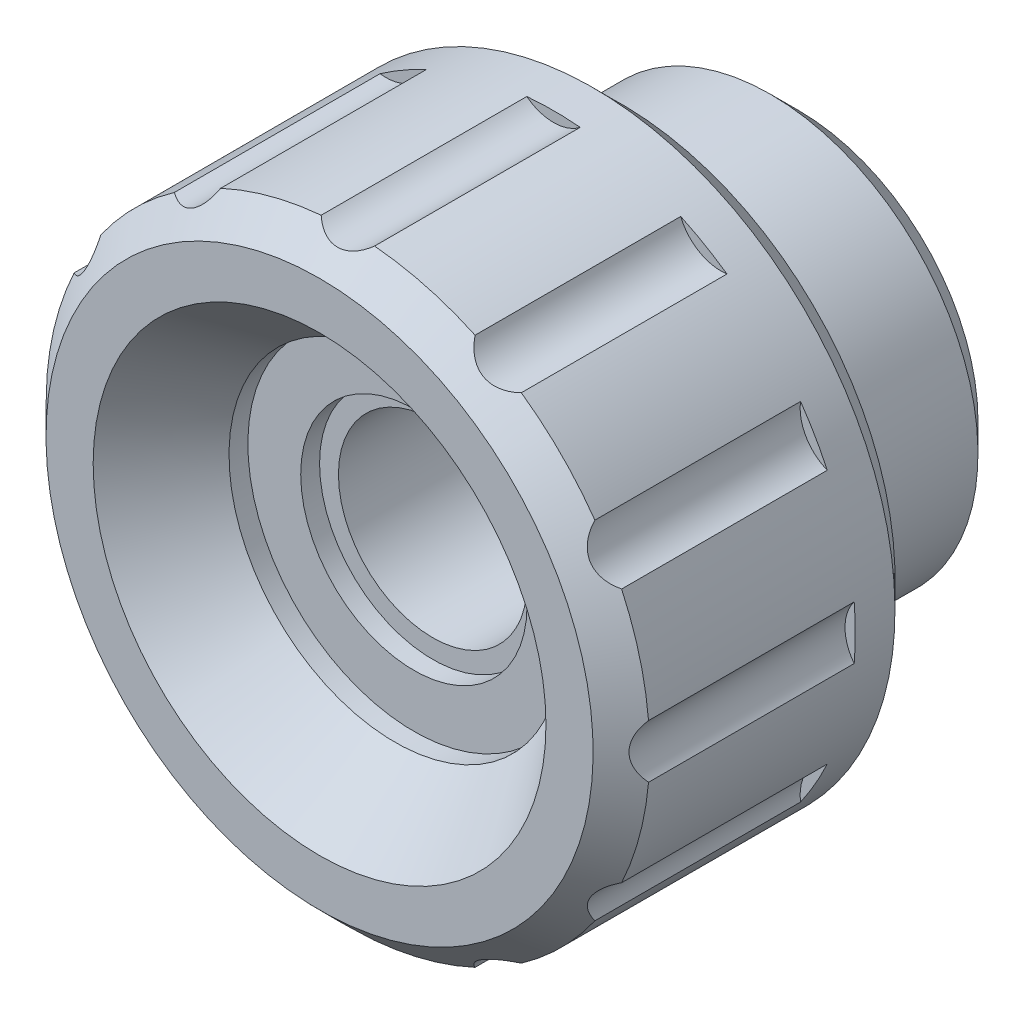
ISO-10303-21;
HEADER;
FILE_DESCRIPTION(('STEP AP214'),'2;1');
FILE_NAME('part.step','',(''),(''),'','','');
FILE_SCHEMA(('AUTOMOTIVE_DESIGN { 1 0 10303 214 1 1 1 1 }'));
ENDSEC;
DATA;
#1=APPLICATION_CONTEXT('core data for automotive mechanical design processes');
#2=APPLICATION_PROTOCOL_DEFINITION('international standard','automotive_design',2000,#1);
#3=PRODUCT_CONTEXT('',#1,'mechanical');
#4=PRODUCT('Part','Part','',(#3));
#5=PRODUCT_RELATED_PRODUCT_CATEGORY('part','',(#4));
#6=PRODUCT_DEFINITION_FORMATION('','',#4);
#7=PRODUCT_DEFINITION_CONTEXT('part definition',#1,'design');
#8=PRODUCT_DEFINITION('design','',#6,#7);
#9=PRODUCT_DEFINITION_SHAPE('','',#8);
#10=(LENGTH_UNIT() NAMED_UNIT(*) SI_UNIT(.MILLI.,.METRE.));
#11=(NAMED_UNIT(*) PLANE_ANGLE_UNIT() SI_UNIT($,.RADIAN.));
#12=(NAMED_UNIT(*) SI_UNIT($,.STERADIAN.) SOLID_ANGLE_UNIT());
#13=UNCERTAINTY_MEASURE_WITH_UNIT(LENGTH_MEASURE(1.E-05),#10,'distance_accuracy_value','');
#14=(GEOMETRIC_REPRESENTATION_CONTEXT(3) GLOBAL_UNCERTAINTY_ASSIGNED_CONTEXT((#13)) GLOBAL_UNIT_ASSIGNED_CONTEXT((#10,
#11,#12)) REPRESENTATION_CONTEXT('',''));
#15=CARTESIAN_POINT('',(0.,0.,0.));
#16=DIRECTION('',(0.,0.,1.));
#17=DIRECTION('',(1.,0.,0.));
#18=AXIS2_PLACEMENT_3D('',#15,#16,#17);
#19=CARTESIAN_POINT('',(0.,0.,6.));
#20=DIRECTION('',(0.,0.,-1.));
#21=DIRECTION('',(-1.,0.,0.));
#22=AXIS2_PLACEMENT_3D('',#19,#20,#21);
#23=CYLINDRICAL_SURFACE('',#22,2.5);
#24=CARTESIAN_POINT('',(0.,0.,0.449999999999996));
#25=DIRECTION('',(0.,0.,-1.));
#26=DIRECTION('',(-1.,0.,0.));
#27=AXIS2_PLACEMENT_3D('',#24,#25,#26);
#28=CIRCLE('',#27,2.5);
#29=CARTESIAN_POINT('',(-2.5,0.,0.449999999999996));
#30=VERTEX_POINT('',#29);
#31=EDGE_CURVE('E23',#30,#30,#28,.T.);
#32=ORIENTED_EDGE('',*,*,#31,.T.);
#33=EDGE_LOOP('',(#32));
#34=FACE_BOUND('',#33,.T.);
#35=CARTESIAN_POINT('',(0.,0.,10.0000000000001));
#36=DIRECTION('',(0.,0.,1.));
#37=DIRECTION('',(1.,0.,0.));
#38=AXIS2_PLACEMENT_3D('',#35,#36,#37);
#39=CIRCLE('',#38,2.5);
#40=CARTESIAN_POINT('',(2.5,0.,10.0000000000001));
#41=VERTEX_POINT('',#40);
#42=EDGE_CURVE('E18',#41,#41,#39,.F.);
#43=ORIENTED_EDGE('',*,*,#42,.F.);
#44=EDGE_LOOP('',(#43));
#45=FACE_BOUND('',#44,.T.);
#46=ADVANCED_FACE('F14',(#34,#45),#23,.F.);
#47=CARTESIAN_POINT('',(3.49999999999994,0.,0.));
#48=DIRECTION('',(0.,0.,-1.));
#49=DIRECTION('',(0.,1.,0.));
#50=AXIS2_PLACEMENT_3D('',#47,#48,#49);
#51=PLANE('',#50);
#52=CARTESIAN_POINT('',(0.,0.,0.));
#53=DIRECTION('',(0.,0.,-1.));
#54=DIRECTION('',(-1.,0.,0.));
#55=AXIS2_PLACEMENT_3D('',#52,#53,#54);
#56=CIRCLE('',#55,2.95);
#57=CARTESIAN_POINT('',(-2.95,0.,0.));
#58=VERTEX_POINT('',#57);
#59=EDGE_CURVE('E9',#58,#58,#56,.F.);
#60=ORIENTED_EDGE('',*,*,#59,.T.);
#61=EDGE_LOOP('',(#60));
#62=FACE_BOUND('',#61,.T.);
#63=CARTESIAN_POINT('',(0.,0.,0.));
#64=DIRECTION('',(0.,0.,-1.));
#65=DIRECTION('',(0.,1.,0.));
#66=AXIS2_PLACEMENT_3D('',#63,#64,#65);
#67=CIRCLE('',#66,3.49999999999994);
#68=CARTESIAN_POINT('',(0.,3.49999999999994,0.));
#69=VERTEX_POINT('',#68);
#70=EDGE_CURVE('E354',#69,#69,#67,.T.);
#71=ORIENTED_EDGE('',*,*,#70,.T.);
#72=EDGE_LOOP('',(#71));
#73=FACE_BOUND('',#72,.T.);
#74=ADVANCED_FACE('F406',(#62,#73),#51,.T.);
#75=CARTESIAN_POINT('',(0.,0.,0.));
#76=DIRECTION('',(0.,0.,-1.));
#77=DIRECTION('',(0.,1.,0.));
#78=AXIS2_PLACEMENT_3D('',#75,#76,#77);
#79=CYLINDRICAL_SURFACE('',#78,3.49999999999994);
#80=CARTESIAN_POINT('',(0.,0.,0.300000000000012));
#81=DIRECTION('',(0.,0.,-1.));
#82=DIRECTION('',(0.,1.,0.));
#83=AXIS2_PLACEMENT_3D('',#80,#81,#82);
#84=CIRCLE('',#83,3.49999999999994);
#85=CARTESIAN_POINT('',(0.,3.49999999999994,0.300000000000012));
#86=VERTEX_POINT('',#85);
#87=EDGE_CURVE('E351',#86,#86,#84,.T.);
#88=ORIENTED_EDGE('',*,*,#87,.T.);
#89=EDGE_LOOP('',(#88));
#90=FACE_BOUND('',#89,.T.);
#91=ORIENTED_EDGE('',*,*,#70,.F.);
#92=EDGE_LOOP('',(#91));
#93=FACE_BOUND('',#92,.T.);
#94=ADVANCED_FACE('F413',(#90,#93),#79,.T.);
#95=CARTESIAN_POINT('',(4.74999999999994,0.,0.300000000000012));
#96=DIRECTION('',(0.,0.,-1.));
#97=DIRECTION('',(0.,1.,0.));
#98=AXIS2_PLACEMENT_3D('',#95,#96,#97);
#99=PLANE('',#98);
#100=CARTESIAN_POINT('',(0.,0.,0.300000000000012));
#101=DIRECTION('',(0.,0.,-1.));
#102=DIRECTION('',(0.,1.,0.));
#103=AXIS2_PLACEMENT_3D('',#100,#101,#102);
#104=CIRCLE('',#103,4.74999999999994);
#105=CARTESIAN_POINT('',(0.,4.74999999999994,0.300000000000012));
#106=VERTEX_POINT('',#105);
#107=EDGE_CURVE('E348',#106,#106,#104,.T.);
#108=ORIENTED_EDGE('',*,*,#107,.T.);
#109=EDGE_LOOP('',(#108));
#110=FACE_BOUND('',#109,.T.);
#111=ORIENTED_EDGE('',*,*,#87,.F.);
#112=EDGE_LOOP('',(#111));
#113=FACE_BOUND('',#112,.T.);
#114=ADVANCED_FACE('F818',(#110,#113),#99,.T.);
#115=CARTESIAN_POINT('',(0.,0.,0.300000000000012));
#116=DIRECTION('',(0.,0.,1.));
#117=DIRECTION('',(0.,-1.,0.));
#118=AXIS2_PLACEMENT_3D('',#115,#116,#117);
#119=CONICAL_SURFACE('',#118,4.74999999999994,0.785398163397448);
#120=CARTESIAN_POINT('',(0.,0.,1.05000000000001));
#121=DIRECTION('',(0.,0.,-1.));
#122=DIRECTION('',(0.,1.,0.));
#123=AXIS2_PLACEMENT_3D('',#120,#121,#122);
#124=CIRCLE('',#123,5.49999999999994);
#125=CARTESIAN_POINT('',(0.,5.49999999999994,1.05000000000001));
#126=VERTEX_POINT('',#125);
#127=EDGE_CURVE('E344',#126,#126,#124,.T.);
#128=ORIENTED_EDGE('',*,*,#127,.T.);
#129=EDGE_LOOP('',(#128));
#130=FACE_BOUND('',#129,.T.);
#131=ORIENTED_EDGE('',*,*,#107,.F.);
#132=EDGE_LOOP('',(#131));
#133=FACE_BOUND('',#132,.T.);
#134=ADVANCED_FACE('F828',(#130,#133),#119,.T.);
#135=CARTESIAN_POINT('',(0.,0.,0.));
#136=DIRECTION('',(0.,0.,-1.));
#137=DIRECTION('',(0.,1.,0.));
#138=AXIS2_PLACEMENT_3D('',#135,#136,#137);
#139=CYLINDRICAL_SURFACE('',#138,5.49999999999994);
#140=CARTESIAN_POINT('',(0.,0.,5.));
#141=DIRECTION('',(0.,0.,-1.));
#142=DIRECTION('',(-1.,0.,0.));
#143=AXIS2_PLACEMENT_3D('',#140,#141,#142);
#144=CIRCLE('',#143,5.49999999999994);
#145=CARTESIAN_POINT('',(-5.49999999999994,0.,5.));
#146=VERTEX_POINT('',#145);
#147=EDGE_CURVE('E211',#146,#146,#144,.F.);
#148=ORIENTED_EDGE('',*,*,#147,.F.);
#149=EDGE_LOOP('',(#148));
#150=FACE_BOUND('',#149,.T.);
#151=ORIENTED_EDGE('',*,*,#127,.F.);
#152=EDGE_LOOP('',(#151));
#153=FACE_BOUND('',#152,.T.);
#154=ADVANCED_FACE('F425',(#150,#153),#139,.T.);
#155=CARTESIAN_POINT('',(0.,8.,5.));
#156=DIRECTION('',(0.,0.,-1.));
#157=DIRECTION('',(-1.,0.,0.));
#158=AXIS2_PLACEMENT_3D('',#155,#156,#157);
#159=PLANE('',#158);
#160=CARTESIAN_POINT('',(0.,0.,5.));
#161=DIRECTION('',(0.,0.,-1.));
#162=DIRECTION('',(-1.,0.,0.));
#163=AXIS2_PLACEMENT_3D('',#160,#161,#162);
#164=CIRCLE('',#163,7.25);
#165=CARTESIAN_POINT('',(-7.25,0.,5.));
#166=VERTEX_POINT('',#165);
#167=EDGE_CURVE('E216',#166,#166,#164,.T.);
#168=ORIENTED_EDGE('',*,*,#167,.T.);
#169=EDGE_LOOP('',(#168));
#170=FACE_BOUND('',#169,.T.);
#171=ORIENTED_EDGE('',*,*,#147,.T.);
#172=EDGE_LOOP('',(#171));
#173=FACE_BOUND('',#172,.T.);
#174=ADVANCED_FACE('F422',(#170,#173),#159,.T.);
#175=CARTESIAN_POINT('',(4.4,0.,10.5000000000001));
#176=DIRECTION('',(0.,0.,1.));
#177=DIRECTION('',(0.,-1.,0.));
#178=AXIS2_PLACEMENT_3D('',#175,#176,#177);
#179=PLANE('',#178);
#180=CARTESIAN_POINT('',(0.,0.,10.5000000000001));
#181=DIRECTION('',(0.,0.,1.));
#182=DIRECTION('',(1.,0.,0.));
#183=AXIS2_PLACEMENT_3D('',#180,#181,#182);
#184=CIRCLE('',#183,3.);
#185=CARTESIAN_POINT('',(3.,0.,10.5000000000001));
#186=VERTEX_POINT('',#185);
#187=EDGE_CURVE('E898',#186,#186,#184,.T.);
#188=ORIENTED_EDGE('',*,*,#187,.F.);
#189=EDGE_LOOP('',(#188));
#190=FACE_BOUND('',#189,.T.);
#191=CARTESIAN_POINT('',(0.,0.,10.5000000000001));
#192=DIRECTION('',(0.,0.,-1.));
#193=DIRECTION('',(0.,1.,0.));
#194=AXIS2_PLACEMENT_3D('',#191,#192,#193);
#195=CIRCLE('',#194,4.4);
#196=CARTESIAN_POINT('',(0.,4.4,10.5000000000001));
#197=VERTEX_POINT('',#196);
#198=EDGE_CURVE('E288',#197,#197,#195,.T.);
#199=ORIENTED_EDGE('',*,*,#198,.F.);
#200=EDGE_LOOP('',(#199));
#201=FACE_BOUND('',#200,.T.);
#202=ADVANCED_FACE('F394',(#190,#201),#179,.T.);
#203=CARTESIAN_POINT('',(0.,0.,0.));
#204=DIRECTION('',(0.,0.,-1.));
#205=DIRECTION('',(0.,1.,0.));
#206=AXIS2_PLACEMENT_3D('',#203,#204,#205);
#207=CYLINDRICAL_SURFACE('',#206,4.4);
#208=ORIENTED_EDGE('',*,*,#198,.T.);
#209=EDGE_LOOP('',(#208));
#210=FACE_BOUND('',#209,.T.);
#211=CARTESIAN_POINT('',(0.,0.,11.));
#212=DIRECTION('',(0.,0.,-1.));
#213=DIRECTION('',(0.,1.,0.));
#214=AXIS2_PLACEMENT_3D('',#211,#212,#213);
#215=CIRCLE('',#214,4.4);
#216=CARTESIAN_POINT('',(0.,4.4,11.));
#217=VERTEX_POINT('',#216);
#218=EDGE_CURVE('E332',#217,#217,#215,.T.);
#219=ORIENTED_EDGE('',*,*,#218,.F.);
#220=EDGE_LOOP('',(#219));
#221=FACE_BOUND('',#220,.T.);
#222=ADVANCED_FACE('F390',(#210,#221),#207,.F.);
#223=CARTESIAN_POINT('',(0.,0.,13.));
#224=DIRECTION('',(0.,0.,1.));
#225=DIRECTION('',(0.,-1.,0.));
#226=AXIS2_PLACEMENT_3D('',#223,#224,#225);
#227=CONICAL_SURFACE('',#226,6.,0.67474094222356);
#228=ORIENTED_EDGE('',*,*,#218,.T.);
#229=EDGE_LOOP('',(#228));
#230=FACE_BOUND('',#229,.T.);
#231=CARTESIAN_POINT('',(0.,0.,13.));
#232=DIRECTION('',(0.,0.,-1.));
#233=DIRECTION('',(0.,1.,0.));
#234=AXIS2_PLACEMENT_3D('',#231,#232,#233);
#235=CIRCLE('',#234,6.);
#236=CARTESIAN_POINT('',(0.,6.,13.));
#237=VERTEX_POINT('',#236);
#238=EDGE_CURVE('E335',#237,#237,#235,.T.);
#239=ORIENTED_EDGE('',*,*,#238,.F.);
#240=EDGE_LOOP('',(#239));
#241=FACE_BOUND('',#240,.T.);
#242=ADVANCED_FACE('F393',(#230,#241),#227,.F.);
#243=CARTESIAN_POINT('',(6.,0.,13.));
#244=DIRECTION('',(0.,0.,1.));
#245=DIRECTION('',(0.,-1.,0.));
#246=AXIS2_PLACEMENT_3D('',#243,#244,#245);
#247=PLANE('',#246);
#248=ORIENTED_EDGE('',*,*,#238,.T.);
#249=EDGE_LOOP('',(#248));
#250=FACE_BOUND('',#249,.T.);
#251=CARTESIAN_POINT('',(0.,0.,13.));
#252=DIRECTION('',(0.,0.,-1.));
#253=DIRECTION('',(0.,1.,0.));
#254=AXIS2_PLACEMENT_3D('',#251,#252,#253);
#255=CIRCLE('',#254,7.25);
#256=CARTESIAN_POINT('',(0.,7.25,13.));
#257=VERTEX_POINT('',#256);
#258=EDGE_CURVE('E338',#257,#257,#255,.T.);
#259=ORIENTED_EDGE('',*,*,#258,.F.);
#260=EDGE_LOOP('',(#259));
#261=FACE_BOUND('',#260,.T.);
#262=ADVANCED_FACE('F386',(#250,#261),#247,.T.);
#263=CARTESIAN_POINT('',(0.,0.,6.8));
#264=DIRECTION('',(0.,0.,1.));
#265=DIRECTION('',(0.,-1.,0.));
#266=AXIS2_PLACEMENT_3D('',#263,#264,#265);
#267=PLANE('',#266);
#268=CARTESIAN_POINT('',(-1.2490009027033E-13,-8.87500000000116,6.8));
#269=DIRECTION('',(0.,0.,-1.));
#270=DIRECTION('',(0.,-1.,0.));
#271=AXIS2_PLACEMENT_3D('',#268,#269,#270);
#272=CIRCLE('',#271,1.15);
#273=CARTESIAN_POINT('',(-0.707804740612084,-7.96862676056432,6.8));
#274=VERTEX_POINT('',#273);
#275=CARTESIAN_POINT('',(0.70780474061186,-7.96862676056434,6.8));
#276=VERTEX_POINT('',#275);
#277=EDGE_CURVE('E275',#274,#276,#272,.T.);
#278=ORIENTED_EDGE('',*,*,#277,.F.);
#279=CARTESIAN_POINT('',(0.,0.,6.8));
#280=DIRECTION('',(0.,0.,1.));
#281=DIRECTION('',(0.,-1.,0.));
#282=AXIS2_PLACEMENT_3D('',#279,#280,#281);
#283=CIRCLE('',#282,8.);
#284=EDGE_CURVE('E222',#276,#274,#283,.F.);
#285=ORIENTED_EDGE('',*,*,#284,.F.);
#286=EDGE_LOOP('',(#278,#285));
#287=FACE_BOUND('',#286,.T.);
#288=ADVANCED_FACE('F382',(#287),#267,.T.);
#289=CARTESIAN_POINT('',(-1.2490009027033E-13,-8.87500000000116,6.8));
#290=DIRECTION('',(0.,0.,1.));
#291=DIRECTION('',(0.,-1.,0.));
#292=AXIS2_PLACEMENT_3D('',#289,#290,#291);
#293=CYLINDRICAL_SURFACE('',#292,1.15);
#294=DIRECTION('',(0.,0.,1.));
#295=VECTOR('',#294,1.);
#296=CARTESIAN_POINT('',(-0.707804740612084,-7.96862676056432,6.8));
#297=LINE('',#296,#295);
#298=CARTESIAN_POINT('',(-0.707804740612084,-7.96862676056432,12.2499999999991));
#299=VERTEX_POINT('',#298);
#300=EDGE_CURVE('E301',#274,#299,#297,.T.);
#301=ORIENTED_EDGE('',*,*,#300,.F.);
#302=ORIENTED_EDGE('',*,*,#277,.T.);
#303=DIRECTION('',(0.,0.,1.));
#304=VECTOR('',#303,1.);
#305=CARTESIAN_POINT('',(0.70780474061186,-7.96862676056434,6.8));
#306=LINE('',#305,#304);
#307=CARTESIAN_POINT('',(0.707804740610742,-7.96862676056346,12.25));
#308=VERTEX_POINT('',#307);
#309=EDGE_CURVE('E299',#276,#308,#306,.T.);
#310=ORIENTED_EDGE('',*,*,#309,.T.);
#311=CARTESIAN_POINT('',(-0.708004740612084,-7.96878298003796,12.2498266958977));
#312=CARTESIAN_POINT('',(-0.670016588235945,-7.93910304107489,12.2827435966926));
#313=CARTESIAN_POINT('',(-0.629096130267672,-7.91098728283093,12.3141461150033));
#314=CARTESIAN_POINT('',(-0.541113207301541,-7.85895957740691,12.3725489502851));
#315=CARTESIAN_POINT('',(-0.493993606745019,-7.83509230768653,12.3995022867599));
#316=CARTESIAN_POINT('',(-0.403110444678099,-7.79705455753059,12.4426329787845));
#317=CARTESIAN_POINT('',(-0.360275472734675,-7.7819114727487,12.4598771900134));
#318=CARTESIAN_POINT('',(-0.271519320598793,-7.75656520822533,12.4888070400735));
#319=CARTESIAN_POINT('',(-0.225610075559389,-7.74634405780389,12.5005128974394));
#320=CARTESIAN_POINT('',(-0.131281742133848,-7.73151414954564,12.5175147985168));
#321=CARTESIAN_POINT('',(-0.0828445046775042,-7.72695427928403,12.522755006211));
#322=CARTESIAN_POINT('',(0.014487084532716,-7.72406175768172,12.5260777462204));
#323=CARTESIAN_POINT('',(0.0633815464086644,-7.72573064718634,12.5241585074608));
#324=CARTESIAN_POINT('',(0.154026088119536,-7.73456075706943,12.5140225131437));
#325=CARTESIAN_POINT('',(0.195934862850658,-7.74104594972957,12.5065809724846));
#326=CARTESIAN_POINT('',(0.277692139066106,-7.7582480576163,12.4868901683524));
#327=CARTESIAN_POINT('',(0.31753961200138,-7.76896706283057,12.4746385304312));
#328=CARTESIAN_POINT('',(0.408286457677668,-7.79851491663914,12.440973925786));
#329=CARTESIAN_POINT('',(0.458050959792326,-7.8188729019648,12.4178517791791));
#330=CARTESIAN_POINT('',(0.551931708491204,-7.86474498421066,12.3660439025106));
#331=CARTESIAN_POINT('',(0.596041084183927,-7.89026525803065,12.3373515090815));
#332=CARTESIAN_POINT('',(0.661880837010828,-7.93410696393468,12.2883657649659));
#333=CARTESIAN_POINT('',(0.685443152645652,-7.95116148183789,12.2693731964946));
#334=CARTESIAN_POINT('',(0.708004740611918,-7.96878298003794,12.2498266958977));
#335=B_SPLINE_CURVE_WITH_KNOTS('',3,(#311,#312,#313,#314,#315,#316,#317,#318,#319,#320,#321,
#322,#323,#324,#325,#326,#327,#328,#329,#330,#331,#332,#333,#334),.UNSPECIFIED.,.F.,.F.,(4,2,2,
2,2,2,2,2,2,2,2,4),(0.,0.17542065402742,0.352589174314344,0.497789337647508,0.642455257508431,
0.78836193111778,0.934304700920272,1.06290984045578,1.19157854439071,1.36619586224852,
1.54102336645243,1.64509140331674),.UNSPECIFIED.);
#336=EDGE_CURVE('E454',#299,#308,#335,.T.);
#337=ORIENTED_EDGE('',*,*,#336,.F.);
#338=EDGE_LOOP('',(#301,#302,#310,#337));
#339=FACE_BOUND('',#338,.T.);
#340=ADVANCED_FACE('F385',(#339),#293,.F.);
#341=CARTESIAN_POINT('',(4.43750000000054,-7.68597545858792,6.8));
#342=DIRECTION('',(0.,0.,-1.));
#343=DIRECTION('',(0.,-1.,0.));
#344=AXIS2_PLACEMENT_3D('',#341,#342,#343);
#345=CIRCLE('',#344,1.15);
#346=CARTESIAN_POINT('',(3.37133649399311,-7.25493557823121,6.8));
#347=VERTEX_POINT('',#346);
#348=CARTESIAN_POINT('',(4.59729026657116,-6.54713083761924,6.8));
#349=VERTEX_POINT('',#348);
#350=EDGE_CURVE('E278',#347,#349,#345,.T.);
#351=ORIENTED_EDGE('',*,*,#350,.F.);
#352=EDGE_CURVE('E218',#349,#347,#283,.F.);
#353=ORIENTED_EDGE('',*,*,#352,.F.);
#354=EDGE_LOOP('',(#351,#353));
#355=FACE_BOUND('',#354,.T.);
#356=ADVANCED_FACE('F389',(#355),#267,.T.);
#357=CARTESIAN_POINT('',(4.43750000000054,-7.68597545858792,6.8));
#358=DIRECTION('',(0.,0.,1.));
#359=DIRECTION('',(0.,-1.,0.));
#360=AXIS2_PLACEMENT_3D('',#357,#358,#359);
#361=CYLINDRICAL_SURFACE('',#360,1.15);
#362=DIRECTION('',(0.,0.,1.));
#363=VECTOR('',#362,1.);
#364=CARTESIAN_POINT('',(3.37133649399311,-7.25493557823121,6.8));
#365=LINE('',#364,#363);
#366=CARTESIAN_POINT('',(3.37133649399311,-7.25493557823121,12.2499999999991));
#367=VERTEX_POINT('',#366);
#368=EDGE_CURVE('E297',#347,#367,#365,.T.);
#369=ORIENTED_EDGE('',*,*,#368,.F.);
#370=ORIENTED_EDGE('',*,*,#350,.T.);
#371=DIRECTION('',(0.,0.,1.));
#372=VECTOR('',#371,1.);
#373=CARTESIAN_POINT('',(4.59729026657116,-6.54713083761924,6.8));
#374=LINE('',#373,#372);
#375=CARTESIAN_POINT('',(4.59729026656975,-6.54713083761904,12.25));
#376=VERTEX_POINT('',#375);
#377=EDGE_CURVE('E295',#349,#376,#374,.T.);
#378=ORIENTED_EDGE('',*,*,#377,.T.);
#379=CARTESIAN_POINT('',(3.37125565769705,-7.25513557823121,12.2498526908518));
#380=CARTESIAN_POINT('',(3.38931533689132,-7.2104398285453,12.2827673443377));
#381=CARTESIAN_POINT('',(3.41069638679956,-7.16563264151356,12.3141675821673));
#382=CARTESIAN_POINT('',(3.46087905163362,-7.07658806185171,12.3725658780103));
#383=CARTESIAN_POINT('',(3.48975247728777,-7.032360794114,12.399516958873));
#384=CARTESIAN_POINT('',(3.54944136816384,-6.95398075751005,12.4426442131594));
#385=CARTESIAN_POINT('',(3.57896658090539,-6.91945000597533,12.459887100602));
#386=CARTESIAN_POINT('',(3.64315945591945,-6.85312362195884,12.4888142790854));
#387=CARTESIAN_POINT('',(3.67780779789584,-6.82131839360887,12.5005187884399));
#388=CARTESIAN_POINT('',(3.75208390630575,-6.76131362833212,12.5175180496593));
#389=CARTESIAN_POINT('',(3.79175182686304,-6.73314735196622,12.5227569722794));
#390=CARTESIAN_POINT('',(3.87459677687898,-6.68197914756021,12.5260773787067));
#391=CARTESIAN_POINT('',(3.91777467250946,-6.65897849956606,12.5241570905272));
#392=CARTESIAN_POINT('',(4.00068974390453,-6.62130533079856,12.5140193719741));
#393=CARTESIAN_POINT('',(4.04022639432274,-6.60596809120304,12.5065770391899));
#394=CARTESIAN_POINT('',(4.1196311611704,-6.57998847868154,12.4868847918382));
#395=CARTESIAN_POINT('',(4.15949943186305,-6.56934843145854,12.4746325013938));
#396=CARTESIAN_POINT('',(4.25286326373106,-6.54956561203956,12.4409660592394));
#397=CARTESIAN_POINT('',(4.30614049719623,-6.54231471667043,12.4178426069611));
#398=CARTESIAN_POINT('',(4.41038121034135,-6.53510255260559,12.3660321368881));
#399=CARTESIAN_POINT('',(4.46134183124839,-6.53515005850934,12.3373384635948));
#400=CARTESIAN_POINT('',(4.54025639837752,-6.54019818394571,12.2883669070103));
#401=CARTESIAN_POINT('',(4.56916440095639,-6.54318368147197,12.269391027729));
#402=CARTESIAN_POINT('',(4.59749026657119,-6.5471589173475,12.2498620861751));
#403=B_SPLINE_CURVE_WITH_KNOTS('',3,(#379,#380,#381,#382,#383,#384,#385,#386,#387,#388,#389,
#390,#391,#392,#393,#394,#395,#396,#397,#398,#399,#400,#401,#402),.UNSPECIFIED.,.F.,.F.,(4,2,2,
2,2,2,2,2,2,2,2,4),(0.,0.175413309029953,0.352574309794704,0.497771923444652,0.64243531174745,
0.788339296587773,0.934279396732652,1.06288407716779,1.19155236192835,1.36617341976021,
1.54100441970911,1.64498267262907),.UNSPECIFIED.);
#404=EDGE_CURVE('E447',#367,#376,#403,.T.);
#405=ORIENTED_EDGE('',*,*,#404,.F.);
#406=EDGE_LOOP('',(#369,#370,#378,#405));
#407=FACE_BOUND('',#406,.T.);
#408=ADVANCED_FACE('F461',(#407),#361,.F.);
#409=CARTESIAN_POINT('',(7.68597545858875,-4.43749999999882,6.8));
#410=DIRECTION('',(0.,0.,-1.));
#411=DIRECTION('',(0.,-1.,0.));
#412=AXIS2_PLACEMENT_3D('',#409,#410,#411);
#413=CIRCLE('',#412,1.15000000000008);
#414=CARTESIAN_POINT('',(6.54713083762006,-4.59729026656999,6.8));
#415=VERTEX_POINT('',#414);
#416=CARTESIAN_POINT('',(7.25493557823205,-3.37133649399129,6.8));
#417=VERTEX_POINT('',#416);
#418=EDGE_CURVE('E281',#415,#417,#413,.T.);
#419=ORIENTED_EDGE('',*,*,#418,.F.);
#420=EDGE_CURVE('E212',#417,#415,#283,.F.);
#421=ORIENTED_EDGE('',*,*,#420,.F.);
#422=EDGE_LOOP('',(#419,#421));
#423=FACE_BOUND('',#422,.T.);
#424=ADVANCED_FACE('F464',(#423),#267,.T.);
#425=CARTESIAN_POINT('',(7.68597545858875,-4.43749999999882,6.8));
#426=DIRECTION('',(0.,0.,1.));
#427=DIRECTION('',(0.,-1.,0.));
#428=AXIS2_PLACEMENT_3D('',#425,#426,#427);
#429=CYLINDRICAL_SURFACE('',#428,1.15000000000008);
#430=DIRECTION('',(0.,0.,1.));
#431=VECTOR('',#430,1.);
#432=CARTESIAN_POINT('',(6.54713083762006,-4.59729026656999,6.8));
#433=LINE('',#432,#431);
#434=CARTESIAN_POINT('',(6.54713083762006,-4.59729026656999,12.2499999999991));
#435=VERTEX_POINT('',#434);
#436=EDGE_CURVE('E293',#415,#435,#433,.T.);
#437=ORIENTED_EDGE('',*,*,#436,.F.);
#438=ORIENTED_EDGE('',*,*,#418,.T.);
#439=DIRECTION('',(0.,0.,1.));
#440=VECTOR('',#439,1.);
#441=CARTESIAN_POINT('',(7.25493557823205,-3.37133649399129,6.8));
#442=LINE('',#441,#440);
#443=CARTESIAN_POINT('',(7.25493557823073,-3.37133649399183,12.25));
#444=VERTEX_POINT('',#443);
#445=EDGE_CURVE('E291',#417,#444,#442,.T.);
#446=ORIENTED_EDGE('',*,*,#445,.T.);
#447=CARTESIAN_POINT('',(6.54715891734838,-4.59749026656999,12.249862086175));
#448=CARTESIAN_POINT('',(6.54045182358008,-4.54975319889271,12.2827759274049));
#449=CARTESIAN_POINT('',(6.53656536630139,-4.50025899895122,12.3141753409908));
#450=CARTESIAN_POINT('',(6.53550363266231,-4.39805391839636,12.3725719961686));
#451=CARTESIAN_POINT('',(6.53839560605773,-4.34531590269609,12.3995222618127));
#452=CARTESIAN_POINT('',(6.55089846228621,-4.24759324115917,12.4426482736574));
#453=CARTESIAN_POINT('',(6.55920303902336,-4.20292634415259,12.4598906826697));
#454=CARTESIAN_POINT('',(6.58163319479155,-4.11339009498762,12.4888168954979));
#455=CARTESIAN_POINT('',(6.59573724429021,-4.06852209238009,12.5005209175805));
#456=CARTESIAN_POINT('',(6.63006040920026,-3.97941910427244,12.5175192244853));
#457=CARTESIAN_POINT('',(6.65033092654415,-3.93519284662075,12.5227576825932));
#458=CARTESIAN_POINT('',(6.69649299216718,-3.84945829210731,12.5260772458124));
#459=CARTESIAN_POINT('',(6.72238593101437,-3.8079506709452,12.5241565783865));
#460=CARTESIAN_POINT('',(6.77535612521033,-3.73386792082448,12.5140182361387));
#461=CARTESIAN_POINT('',(6.80192739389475,-3.70081740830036,12.5065756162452));
#462=CARTESIAN_POINT('',(6.85770436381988,-3.63861654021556,12.486882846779));
#463=CARTESIAN_POINT('',(6.88691136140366,-3.60946812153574,12.4746303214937));
#464=CARTESIAN_POINT('',(6.95787590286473,-3.54565408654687,12.4409632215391));
#465=CARTESIAN_POINT('',(7.00039031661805,-3.51273611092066,12.4178393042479));
#466=CARTESIAN_POINT('',(7.08706015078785,-3.45437012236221,12.3660279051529));
#467=CARTESIAN_POINT('',(7.13121748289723,-3.42893113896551,12.3373337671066));
#468=CARTESIAN_POINT('',(7.20208570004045,-3.39384524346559,12.2883604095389));
#469=CARTESIAN_POINT('',(7.22861528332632,-3.38197627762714,12.2693831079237));
#470=CARTESIAN_POINT('',(7.25513557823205,-3.37125565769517,12.2498526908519));
#471=B_SPLINE_CURVE_WITH_KNOTS('',3,(#447,#448,#449,#450,#451,#452,#453,#454,#455,#456,#457,
#458,#459,#460,#461,#462,#463,#464,#465,#466,#467,#468,#469,#470),.UNSPECIFIED.,.F.,.F.,(4,2,2,
2,2,2,2,2,2,2,2,4),(0.,0.175410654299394,0.352568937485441,0.497765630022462,0.642428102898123,
0.788331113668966,0.934270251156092,1.06287477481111,1.19154289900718,1.36616525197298,
1.54099757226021,1.64498268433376),.UNSPECIFIED.);
#472=EDGE_CURVE('E207',#435,#444,#471,.T.);
#473=ORIENTED_EDGE('',*,*,#472,.F.);
#474=EDGE_LOOP('',(#437,#438,#446,#473));
#475=FACE_BOUND('',#474,.T.);
#476=ADVANCED_FACE('F433',(#475),#429,.F.);
#477=CARTESIAN_POINT('',(8.87500000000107,1.83793952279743E-12,6.8));
#478=DIRECTION('',(0.,0.,-1.));
#479=DIRECTION('',(0.,-1.,0.));
#480=AXIS2_PLACEMENT_3D('',#477,#478,#479);
#481=CIRCLE('',#480,1.15);
#482=CARTESIAN_POINT('',(7.96862676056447,-0.707804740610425,6.8));
#483=VERTEX_POINT('',#482);
#484=CARTESIAN_POINT('',(7.96862676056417,0.707804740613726,6.8));
#485=VERTEX_POINT('',#484);
#486=EDGE_CURVE('E190',#483,#485,#481,.T.);
#487=ORIENTED_EDGE('',*,*,#486,.F.);
#488=EDGE_CURVE('E203',#485,#483,#283,.F.);
#489=ORIENTED_EDGE('',*,*,#488,.F.);
#490=EDGE_LOOP('',(#487,#489));
#491=FACE_BOUND('',#490,.T.);
#492=ADVANCED_FACE('F431',(#491),#267,.T.);
#493=CARTESIAN_POINT('',(8.87500000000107,1.83793952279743E-12,6.8));
#494=DIRECTION('',(0.,0.,1.));
#495=DIRECTION('',(0.,-1.,0.));
#496=AXIS2_PLACEMENT_3D('',#493,#494,#495);
#497=CYLINDRICAL_SURFACE('',#496,1.15);
#498=DIRECTION('',(0.,0.,1.));
#499=VECTOR('',#498,1.);
#500=CARTESIAN_POINT('',(7.96862676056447,-0.707804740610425,6.8));
#501=LINE('',#500,#499);
#502=CARTESIAN_POINT('',(7.96862676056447,-0.707804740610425,12.2499999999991));
#503=VERTEX_POINT('',#502);
#504=EDGE_CURVE('E289',#483,#503,#501,.T.);
#505=ORIENTED_EDGE('',*,*,#504,.F.);
#506=ORIENTED_EDGE('',*,*,#486,.T.);
#507=DIRECTION('',(0.,0.,1.));
#508=VECTOR('',#507,1.);
#509=CARTESIAN_POINT('',(7.96862676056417,0.707804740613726,6.8));
#510=LINE('',#509,#508);
#511=CARTESIAN_POINT('',(7.9686267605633,0.707804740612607,12.25));
#512=VERTEX_POINT('',#511);
#513=EDGE_CURVE('E286',#485,#512,#510,.T.);
#514=ORIENTED_EDGE('',*,*,#513,.T.);
#515=CARTESIAN_POINT('',(7.9687829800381,-0.708004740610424,12.2498266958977));
#516=CARTESIAN_POINT('',(7.93910304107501,-0.670016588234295,12.2827435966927));
#517=CARTESIAN_POINT('',(7.91098728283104,-0.629096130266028,12.3141461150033));
#518=CARTESIAN_POINT('',(7.85895957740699,-0.541113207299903,12.3725489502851));
#519=CARTESIAN_POINT('',(7.83509230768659,-0.49399360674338,12.3995022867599));
#520=CARTESIAN_POINT('',(7.79705455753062,-0.403110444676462,12.4426329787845));
#521=CARTESIAN_POINT('',(7.78191147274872,-0.36027547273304,12.4598771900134));
#522=CARTESIAN_POINT('',(7.75656520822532,-0.271519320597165,12.4888070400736));
#523=CARTESIAN_POINT('',(7.74634405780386,-0.225610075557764,12.5005128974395));
#524=CARTESIAN_POINT('',(7.73151414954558,-0.131281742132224,12.5175147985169));
#525=CARTESIAN_POINT('',(7.72695427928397,-0.0828445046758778,12.5227550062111));
#526=CARTESIAN_POINT('',(7.72406175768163,0.0144870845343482,12.5260777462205));
#527=CARTESIAN_POINT('',(7.72573064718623,0.0633815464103,12.5241585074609));
#528=CARTESIAN_POINT('',(7.7345607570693,0.154026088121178,12.5140225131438));
#529=CARTESIAN_POINT('',(7.74104594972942,0.195934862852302,12.5065809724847));
#530=CARTESIAN_POINT('',(7.75824805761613,0.277692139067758,12.4868901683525));
#531=CARTESIAN_POINT('',(7.76896706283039,0.317539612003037,12.4746385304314));
#532=CARTESIAN_POINT('',(7.79851491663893,0.408286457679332,12.4409739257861));
#533=CARTESIAN_POINT('',(7.81887290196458,0.458050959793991,12.4178517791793));
#534=CARTESIAN_POINT('',(7.86474498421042,0.551931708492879,12.3660439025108));
#535=CARTESIAN_POINT('',(7.89026525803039,0.596041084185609,12.3373515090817));
#536=CARTESIAN_POINT('',(7.93410696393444,0.661880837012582,12.288365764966));
#537=CARTESIAN_POINT('',(7.95116148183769,0.685443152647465,12.2693731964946));
#538=CARTESIAN_POINT('',(7.96878298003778,0.708004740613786,12.2498266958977));
#539=B_SPLINE_CURVE_WITH_KNOTS('',3,(#515,#516,#517,#518,#519,#520,#521,#522,#523,#524,#525,
#526,#527,#528,#529,#530,#531,#532,#533,#534,#535,#536,#537,#538),.UNSPECIFIED.,.F.,.F.,(4,2,2,
2,2,2,2,2,2,2,2,4),(0.,0.175420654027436,0.352589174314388,0.497789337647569,0.642455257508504,
0.788361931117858,0.934304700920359,1.06290984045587,1.19157854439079,1.36619586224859,
1.5410233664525,1.64509140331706),.UNSPECIFIED.);
#540=EDGE_CURVE('E201',#503,#512,#539,.T.);
#541=ORIENTED_EDGE('',*,*,#540,.F.);
#542=EDGE_LOOP('',(#505,#506,#514,#541));
#543=FACE_BOUND('',#542,.T.);
#544=ADVANCED_FACE('F427',(#543),#497,.F.);
#545=CARTESIAN_POINT('',(7.68597545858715,4.43750000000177,6.8));
#546=DIRECTION('',(0.,0.,-1.));
#547=DIRECTION('',(0.,-1.,0.));
#548=AXIS2_PLACEMENT_3D('',#545,#546,#547);
#549=CIRCLE('',#548,1.15);
#550=CARTESIAN_POINT('',(7.25493557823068,3.37133649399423,6.8));
#551=VERTEX_POINT('',#550);
#552=CARTESIAN_POINT('',(6.54713083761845,4.59729026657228,6.8));
#553=VERTEX_POINT('',#552);
#554=EDGE_CURVE('E181',#551,#553,#549,.T.);
#555=ORIENTED_EDGE('',*,*,#554,.F.);
#556=EDGE_CURVE('E194',#553,#551,#283,.F.);
#557=ORIENTED_EDGE('',*,*,#556,.F.);
#558=EDGE_LOOP('',(#555,#557));
#559=FACE_BOUND('',#558,.T.);
#560=ADVANCED_FACE('F193',(#559),#267,.T.);
#561=CARTESIAN_POINT('',(7.68597545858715,4.43750000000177,6.8));
#562=DIRECTION('',(0.,0.,1.));
#563=DIRECTION('',(0.,-1.,0.));
#564=AXIS2_PLACEMENT_3D('',#561,#562,#563);
#565=CYLINDRICAL_SURFACE('',#564,1.15);
#566=DIRECTION('',(0.,0.,1.));
#567=VECTOR('',#566,1.);
#568=CARTESIAN_POINT('',(7.25493557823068,3.37133649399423,6.8));
#569=LINE('',#568,#567);
#570=CARTESIAN_POINT('',(7.25493557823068,3.37133649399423,12.2499999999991));
#571=VERTEX_POINT('',#570);
#572=EDGE_CURVE('E178',#551,#571,#569,.T.);
#573=ORIENTED_EDGE('',*,*,#572,.F.);
#574=ORIENTED_EDGE('',*,*,#554,.T.);
#575=DIRECTION('',(0.,0.,1.));
#576=VECTOR('',#575,1.);
#577=CARTESIAN_POINT('',(6.54713083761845,4.59729026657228,6.8));
#578=LINE('',#577,#576);
#579=CARTESIAN_POINT('',(6.54713083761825,4.59729026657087,12.25));
#580=VERTEX_POINT('',#579);
#581=EDGE_CURVE('E189',#553,#580,#578,.T.);
#582=ORIENTED_EDGE('',*,*,#581,.T.);
#583=CARTESIAN_POINT('',(7.25513557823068,3.37125565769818,12.2498526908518));
#584=CARTESIAN_POINT('',(7.21043982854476,3.38931533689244,12.2827673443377));
#585=CARTESIAN_POINT('',(7.16563264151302,3.41069638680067,12.3141675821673));
#586=CARTESIAN_POINT('',(7.07658806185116,3.46087905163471,12.3725658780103));
#587=CARTESIAN_POINT('',(7.03236079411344,3.48975247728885,12.399516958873));
#588=CARTESIAN_POINT('',(6.95398075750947,3.5494413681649,12.4426442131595));
#589=CARTESIAN_POINT('',(6.91945000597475,3.57896658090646,12.459887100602));
#590=CARTESIAN_POINT('',(6.85312362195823,3.6431594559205,12.4888142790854));
#591=CARTESIAN_POINT('',(6.82131839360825,3.67780779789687,12.50051878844));
#592=CARTESIAN_POINT('',(6.76131362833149,3.75208390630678,12.5175180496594));
#593=CARTESIAN_POINT('',(6.73314735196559,3.79175182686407,12.5227569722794));
#594=CARTESIAN_POINT('',(6.68197914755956,3.87459677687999,12.5260773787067));
#595=CARTESIAN_POINT('',(6.6589784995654,3.91777467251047,12.5241570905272));
#596=CARTESIAN_POINT('',(6.62130533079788,4.00068974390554,12.5140193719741));
#597=CARTESIAN_POINT('',(6.60596809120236,4.04022639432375,12.50657703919));
#598=CARTESIAN_POINT('',(6.57998847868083,4.1196311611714,12.4868847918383));
#599=CARTESIAN_POINT('',(6.56934843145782,4.15949943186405,12.4746325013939));
#600=CARTESIAN_POINT('',(6.54956561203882,4.25286326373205,12.4409660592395));
#601=CARTESIAN_POINT('',(6.54231471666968,4.30614049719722,12.4178426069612));
#602=CARTESIAN_POINT('',(6.53510255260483,4.41038121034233,12.3660321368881));
#603=CARTESIAN_POINT('',(6.53515005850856,4.46134183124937,12.3373384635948));
#604=CARTESIAN_POINT('',(6.54019818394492,4.54025639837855,12.2883669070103));
#605=CARTESIAN_POINT('',(6.54318368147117,4.56916440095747,12.269391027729));
#606=CARTESIAN_POINT('',(6.54715891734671,4.59749026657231,12.2498620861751));
#607=B_SPLINE_CURVE_WITH_KNOTS('',3,(#583,#584,#585,#586,#587,#588,#589,#590,#591,#592,#593,
#594,#595,#596,#597,#598,#599,#600,#601,#602,#603,#604,#605,#606),.UNSPECIFIED.,.F.,.F.,(4,2,2,
2,2,2,2,2,2,2,2,4),(0.,0.175413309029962,0.352574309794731,0.497771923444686,0.642435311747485,
0.788339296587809,0.934279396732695,1.06288407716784,1.1915523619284,1.36617341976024,
1.54100441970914,1.64498267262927),.UNSPECIFIED.);
#608=EDGE_CURVE('E184',#571,#580,#607,.T.);
#609=ORIENTED_EDGE('',*,*,#608,.F.);
#610=EDGE_LOOP('',(#573,#574,#582,#609));
#611=FACE_BOUND('',#610,.T.);
#612=ADVANCED_FACE('F180',(#611),#565,.F.);
#613=CARTESIAN_POINT('',(4.43750000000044,7.68597545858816,6.8));
#614=DIRECTION('',(0.,0.,-1.));
#615=DIRECTION('',(0.,-1.,0.));
#616=AXIS2_PLACEMENT_3D('',#613,#614,#615);
#617=CIRCLE('',#616,1.15);
#618=CARTESIAN_POINT('',(4.59729026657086,6.54713083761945,6.8));
#619=VERTEX_POINT('',#618);
#620=CARTESIAN_POINT('',(3.3713364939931,7.25493557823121,6.8));
#621=VERTEX_POINT('',#620);
#622=EDGE_CURVE('E195',#619,#621,#617,.T.);
#623=ORIENTED_EDGE('',*,*,#622,.F.);
#624=EDGE_CURVE('E200',#621,#619,#283,.F.);
#625=ORIENTED_EDGE('',*,*,#624,.F.);
#626=EDGE_LOOP('',(#623,#625));
#627=FACE_BOUND('',#626,.T.);
#628=ADVANCED_FACE('F378',(#627),#267,.T.);
#629=CARTESIAN_POINT('',(4.43750000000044,7.68597545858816,6.8));
#630=DIRECTION('',(0.,0.,1.));
#631=DIRECTION('',(0.,-1.,0.));
#632=AXIS2_PLACEMENT_3D('',#629,#630,#631);
#633=CYLINDRICAL_SURFACE('',#632,1.15);
#634=DIRECTION('',(0.,0.,1.));
#635=VECTOR('',#634,1.);
#636=CARTESIAN_POINT('',(4.59729026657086,6.54713083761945,6.8));
#637=LINE('',#636,#635);
#638=CARTESIAN_POINT('',(4.59729026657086,6.54713083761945,12.2499999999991));
#639=VERTEX_POINT('',#638);
#640=EDGE_CURVE('E326',#619,#639,#637,.T.);
#641=ORIENTED_EDGE('',*,*,#640,.F.);
#642=ORIENTED_EDGE('',*,*,#622,.T.);
#643=DIRECTION('',(0.,0.,1.));
#644=VECTOR('',#643,1.);
#645=CARTESIAN_POINT('',(3.3713364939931,7.25493557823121,6.8));
#646=LINE('',#645,#644);
#647=CARTESIAN_POINT('',(3.37133649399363,7.25493557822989,12.25));
#648=VERTEX_POINT('',#647);
#649=EDGE_CURVE('E324',#621,#648,#646,.T.);
#650=ORIENTED_EDGE('',*,*,#649,.T.);
#651=CARTESIAN_POINT('',(4.59749026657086,6.54715891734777,12.249862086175));
#652=CARTESIAN_POINT('',(4.5497531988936,6.5404518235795,12.2827759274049));
#653=CARTESIAN_POINT('',(4.50025899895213,6.53656536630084,12.3141753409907));
#654=CARTESIAN_POINT('',(4.39805391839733,6.53550363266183,12.3725719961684));
#655=CARTESIAN_POINT('',(4.34531590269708,6.53839560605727,12.3995222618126));
#656=CARTESIAN_POINT('',(4.2475932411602,6.5508984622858,12.4426482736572));
#657=CARTESIAN_POINT('',(4.20292634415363,6.55920303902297,12.4598906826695));
#658=CARTESIAN_POINT('',(4.11339009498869,6.5816331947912,12.4888168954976));
#659=CARTESIAN_POINT('',(4.06852209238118,6.59573724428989,12.5005209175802));
#660=CARTESIAN_POINT('',(3.97941910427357,6.63006040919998,12.517519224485));
#661=CARTESIAN_POINT('',(3.9351928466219,6.65033092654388,12.5227576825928));
#662=CARTESIAN_POINT('',(3.84945829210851,6.69649299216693,12.526077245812));
#663=CARTESIAN_POINT('',(3.80795067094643,6.72238593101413,12.5241565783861));
#664=CARTESIAN_POINT('',(3.73386792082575,6.77535612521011,12.5140182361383));
#665=CARTESIAN_POINT('',(3.70081740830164,6.80192739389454,12.5065756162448));
#666=CARTESIAN_POINT('',(3.63861654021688,6.85770436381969,12.4868828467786));
#667=CARTESIAN_POINT('',(3.60946812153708,6.88691136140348,12.4746303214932));
#668=CARTESIAN_POINT('',(3.54565408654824,6.95787590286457,12.4409632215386));
#669=CARTESIAN_POINT('',(3.51273611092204,7.00039031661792,12.4178393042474));
#670=CARTESIAN_POINT('',(3.45437012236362,7.08706015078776,12.3660279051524));
#671=CARTESIAN_POINT('',(3.42893113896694,7.13121748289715,12.3373337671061));
#672=CARTESIAN_POINT('',(3.39384524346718,7.20208570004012,12.2883604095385));
#673=CARTESIAN_POINT('',(3.38197627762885,7.22861528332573,12.2693831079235));
#674=CARTESIAN_POINT('',(3.37125565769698,7.25513557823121,12.2498526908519));
#675=B_SPLINE_CURVE_WITH_KNOTS('',3,(#651,#652,#653,#654,#655,#656,#657,#658,#659,#660,#661,
#662,#663,#664,#665,#666,#667,#668,#669,#670,#671,#672,#673,#674),.UNSPECIFIED.,.F.,.F.,(4,2,2,
2,2,2,2,2,2,2,2,4),(0.,0.175410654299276,0.35256893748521,0.497765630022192,0.642428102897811,
0.788331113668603,0.934270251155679,1.06287477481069,1.19154289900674,1.36616525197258,
1.54099757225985,1.64498268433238),.UNSPECIFIED.);
#676=EDGE_CURVE('E364',#639,#648,#675,.T.);
#677=ORIENTED_EDGE('',*,*,#676,.F.);
#678=EDGE_LOOP('',(#641,#642,#650,#677));
#679=FACE_BOUND('',#678,.T.);
#680=ADVANCED_FACE('F379',(#679),#633,.F.);
#681=CARTESIAN_POINT('',(9.3198018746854E-13,8.8750000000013,6.8));
#682=DIRECTION('',(0.,0.,-1.));
#683=DIRECTION('',(0.,-1.,0.));
#684=AXIS2_PLACEMENT_3D('',#681,#682,#683);
#685=CIRCLE('',#684,1.15);
#686=CARTESIAN_POINT('',(0.707804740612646,7.96862676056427,6.8));
#687=VERTEX_POINT('',#686);
#688=CARTESIAN_POINT('',(-0.707804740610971,7.96862676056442,6.8));
#689=VERTEX_POINT('',#688);
#690=EDGE_CURVE('E255',#687,#689,#685,.T.);
#691=ORIENTED_EDGE('',*,*,#690,.F.);
#692=EDGE_CURVE('E205',#689,#687,#283,.F.);
#693=ORIENTED_EDGE('',*,*,#692,.F.);
#694=EDGE_LOOP('',(#691,#693));
#695=FACE_BOUND('',#694,.T.);
#696=ADVANCED_FACE('F254',(#695),#267,.T.);
#697=CARTESIAN_POINT('',(9.3198018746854E-13,8.8750000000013,6.8));
#698=DIRECTION('',(0.,0.,1.));
#699=DIRECTION('',(0.,-1.,0.));
#700=AXIS2_PLACEMENT_3D('',#697,#698,#699);
#701=CYLINDRICAL_SURFACE('',#700,1.15);
#702=DIRECTION('',(0.,0.,1.));
#703=VECTOR('',#702,1.);
#704=CARTESIAN_POINT('',(0.707804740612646,7.96862676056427,6.8));
#705=LINE('',#704,#703);
#706=CARTESIAN_POINT('',(0.707804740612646,7.96862676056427,12.2499999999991));
#707=VERTEX_POINT('',#706);
#708=EDGE_CURVE('E249',#687,#707,#705,.T.);
#709=ORIENTED_EDGE('',*,*,#708,.F.);
#710=ORIENTED_EDGE('',*,*,#690,.T.);
#711=DIRECTION('',(0.,0.,1.));
#712=VECTOR('',#711,1.);
#713=CARTESIAN_POINT('',(-0.707804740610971,7.96862676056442,6.8));
#714=LINE('',#713,#712);
#715=CARTESIAN_POINT('',(-0.707804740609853,7.96862676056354,12.25));
#716=VERTEX_POINT('',#715);
#717=EDGE_CURVE('E30',#689,#716,#714,.T.);
#718=ORIENTED_EDGE('',*,*,#717,.T.);
#719=CARTESIAN_POINT('',(0.708004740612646,7.96878298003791,12.2498266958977));
#720=CARTESIAN_POINT('',(0.670016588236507,7.93910304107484,12.2827435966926));
#721=CARTESIAN_POINT('',(0.629096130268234,7.9109872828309,12.3141461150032));
#722=CARTESIAN_POINT('',(0.541113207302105,7.85895957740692,12.372548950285));
#723=CARTESIAN_POINT('',(0.493993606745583,7.83509230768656,12.3995022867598));
#724=CARTESIAN_POINT('',(0.403110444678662,7.79705455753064,12.4426329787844));
#725=CARTESIAN_POINT('',(0.360275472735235,7.78191147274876,12.4598771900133));
#726=CARTESIAN_POINT('',(0.271519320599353,7.7565652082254,12.4888070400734));
#727=CARTESIAN_POINT('',(0.225610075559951,7.74634405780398,12.5005128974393));
#728=CARTESIAN_POINT('',(0.131281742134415,7.73151414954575,12.5175147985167));
#729=CARTESIAN_POINT('',(0.0828445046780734,7.72695427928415,12.5227550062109));
#730=CARTESIAN_POINT('',(-0.0144870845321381,7.72406175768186,12.5260777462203));
#731=CARTESIAN_POINT('',(-0.0633815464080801,7.7257306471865,12.5241585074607));
#732=CARTESIAN_POINT('',(-0.154026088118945,7.73456075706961,12.5140225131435));
#733=CARTESIAN_POINT('',(-0.195934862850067,7.74104594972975,12.5065809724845));
#734=CARTESIAN_POINT('',(-0.277692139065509,7.75824805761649,12.4868901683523));
#735=CARTESIAN_POINT('',(-0.317539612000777,7.76896706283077,12.4746385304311));
#736=CARTESIAN_POINT('',(-0.40828645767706,7.79851491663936,12.4409739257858));
#737=CARTESIAN_POINT('',(-0.458050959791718,7.81887290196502,12.4178517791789));
#738=CARTESIAN_POINT('',(-0.551931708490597,7.86474498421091,12.3660439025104));
#739=CARTESIAN_POINT('',(-0.596041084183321,7.89026525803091,12.3373515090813));
#740=CARTESIAN_POINT('',(-0.66188083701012,7.93410696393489,12.2883657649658));
#741=CARTESIAN_POINT('',(-0.685443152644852,7.95116148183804,12.2693731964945));
#742=CARTESIAN_POINT('',(-0.708004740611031,7.96878298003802,12.2498266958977));
#743=B_SPLINE_CURVE_WITH_KNOTS('',3,(#719,#720,#721,#722,#723,#724,#725,#726,#727,#728,#729,
#730,#731,#732,#733,#734,#735,#736,#737,#738,#739,#740,#741,#742),.UNSPECIFIED.,.F.,.F.,(4,2,2,
2,2,2,2,2,2,2,2,4),(0.,0.175420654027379,0.352589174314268,0.497789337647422,0.642455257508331,
0.788361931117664,0.934304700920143,1.06290984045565,1.19157854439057,1.3661958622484,
1.54102336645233,1.64509140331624),.UNSPECIFIED.);
#744=EDGE_CURVE('E528',#707,#716,#743,.T.);
#745=ORIENTED_EDGE('',*,*,#744,.F.);
#746=EDGE_LOOP('',(#709,#710,#718,#745));
#747=FACE_BOUND('',#746,.T.);
#748=ADVANCED_FACE('F256',(#747),#701,.F.);
#749=CARTESIAN_POINT('',(-4.43749999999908,7.6859754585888,6.8));
#750=DIRECTION('',(0.,0.,-1.));
#751=DIRECTION('',(0.,-1.,0.));
#752=AXIS2_PLACEMENT_3D('',#749,#750,#751);
#753=CIRCLE('',#752,1.14999999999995);
#754=CARTESIAN_POINT('',(-3.37133649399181,7.25493557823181,6.8));
#755=VERTEX_POINT('',#754);
#756=CARTESIAN_POINT('',(-4.5972902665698,6.54713083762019,6.8));
#757=VERTEX_POINT('',#756);
#758=EDGE_CURVE('E257',#755,#757,#753,.T.);
#759=ORIENTED_EDGE('',*,*,#758,.F.);
#760=EDGE_CURVE('E241',#757,#755,#283,.F.);
#761=ORIENTED_EDGE('',*,*,#760,.F.);
#762=EDGE_LOOP('',(#759,#761));
#763=FACE_BOUND('',#762,.T.);
#764=ADVANCED_FACE('F521',(#763),#267,.T.);
#765=CARTESIAN_POINT('',(-4.43749999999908,7.6859754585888,6.8));
#766=DIRECTION('',(0.,0.,1.));
#767=DIRECTION('',(0.,-1.,0.));
#768=AXIS2_PLACEMENT_3D('',#765,#766,#767);
#769=CYLINDRICAL_SURFACE('',#768,1.14999999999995);
#770=DIRECTION('',(0.,0.,1.));
#771=VECTOR('',#770,1.);
#772=CARTESIAN_POINT('',(-3.37133649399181,7.25493557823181,6.8));
#773=LINE('',#772,#771);
#774=CARTESIAN_POINT('',(-3.37133649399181,7.25493557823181,12.2499999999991));
#775=VERTEX_POINT('',#774);
#776=EDGE_CURVE('E320',#755,#775,#773,.T.);
#777=ORIENTED_EDGE('',*,*,#776,.F.);
#778=ORIENTED_EDGE('',*,*,#758,.T.);
#779=DIRECTION('',(0.,0.,1.));
#780=VECTOR('',#779,1.);
#781=CARTESIAN_POINT('',(-4.5972902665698,6.54713083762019,6.8));
#782=LINE('',#781,#780);
#783=CARTESIAN_POINT('',(-4.5972902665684,6.54713083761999,12.25));
#784=VERTEX_POINT('',#783);
#785=EDGE_CURVE('E38',#757,#784,#782,.T.);
#786=ORIENTED_EDGE('',*,*,#785,.T.);
#787=CARTESIAN_POINT('',(-3.37125565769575,7.25513557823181,12.2498526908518));
#788=CARTESIAN_POINT('',(-3.38931533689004,7.21043982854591,12.2827673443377));
#789=CARTESIAN_POINT('',(-3.41069638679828,7.16563264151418,12.3141675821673));
#790=CARTESIAN_POINT('',(-3.46087905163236,7.07658806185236,12.3725658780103));
#791=CARTESIAN_POINT('',(-3.48975247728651,7.03236079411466,12.3995169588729));
#792=CARTESIAN_POINT('',(-3.54944136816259,6.95398075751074,12.4426442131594));
#793=CARTESIAN_POINT('',(-3.57896658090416,6.91945000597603,12.4598871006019));
#794=CARTESIAN_POINT('',(-3.64315945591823,6.85312362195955,12.4888142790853));
#795=CARTESIAN_POINT('',(-3.67780779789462,6.8213183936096,12.5005187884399));
#796=CARTESIAN_POINT('',(-3.75208390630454,6.76131362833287,12.5175180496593));
#797=CARTESIAN_POINT('',(-3.79175182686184,6.73314735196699,12.5227569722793));
#798=CARTESIAN_POINT('',(-3.87459677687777,6.68197914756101,12.5260773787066));
#799=CARTESIAN_POINT('',(-3.91777467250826,6.65897849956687,12.5241570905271));
#800=CARTESIAN_POINT('',(-4.00068974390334,6.62130533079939,12.514019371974));
#801=CARTESIAN_POINT('',(-4.04022639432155,6.60596809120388,12.5065770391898));
#802=CARTESIAN_POINT('',(-4.11963116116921,6.57998847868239,12.4868847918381));
#803=CARTESIAN_POINT('',(-4.15949943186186,6.5693484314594,12.4746325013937));
#804=CARTESIAN_POINT('',(-4.25286326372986,6.54956561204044,12.4409660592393));
#805=CARTESIAN_POINT('',(-4.30614049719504,6.54231471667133,12.417842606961));
#806=CARTESIAN_POINT('',(-4.41038121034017,6.53510255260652,12.3660321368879));
#807=CARTESIAN_POINT('',(-4.4613418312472,6.53515005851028,12.3373384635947));
#808=CARTESIAN_POINT('',(-4.54025639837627,6.54019818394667,12.2883669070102));
#809=CARTESIAN_POINT('',(-4.56916440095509,6.54318368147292,12.269391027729));
#810=CARTESIAN_POINT('',(-4.59749026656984,6.54715891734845,12.2498620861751));
#811=B_SPLINE_CURVE_WITH_KNOTS('',3,(#787,#788,#789,#790,#791,#792,#793,#794,#795,#796,#797,
#798,#799,#800,#801,#802,#803,#804,#805,#806,#807,#808,#809,#810),.UNSPECIFIED.,.F.,.F.,(4,2,2,
2,2,2,2,2,2,2,2,4),(0.,0.175413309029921,0.352574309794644,0.497771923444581,0.642435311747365,
0.788339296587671,0.934279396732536,1.06288407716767,1.19155236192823,1.36617341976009,
1.54100441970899,1.64498267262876),.UNSPECIFIED.);
#812=EDGE_CURVE('E523',#775,#784,#811,.T.);
#813=ORIENTED_EDGE('',*,*,#812,.F.);
#814=EDGE_LOOP('',(#777,#778,#786,#813));
#815=FACE_BOUND('',#814,.T.);
#816=ADVANCED_FACE('F518',(#815),#769,.F.);
#817=CARTESIAN_POINT('',(-7.68597545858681,4.4375000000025,6.8));
#818=DIRECTION('',(0.,0.,-1.));
#819=DIRECTION('',(0.,-1.,0.));
#820=AXIS2_PLACEMENT_3D('',#817,#818,#819);
#821=CIRCLE('',#820,1.15);
#822=CARTESIAN_POINT('',(-6.54713083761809,4.59729026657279,6.8));
#823=VERTEX_POINT('',#822);
#824=CARTESIAN_POINT('',(-7.25493557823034,3.37133649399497,6.8));
#825=VERTEX_POINT('',#824);
#826=EDGE_CURVE('E259',#823,#825,#821,.T.);
#827=ORIENTED_EDGE('',*,*,#826,.F.);
#828=EDGE_CURVE('E237',#825,#823,#283,.F.);
#829=ORIENTED_EDGE('',*,*,#828,.F.);
#830=EDGE_LOOP('',(#827,#829));
#831=FACE_BOUND('',#830,.T.);
#832=ADVANCED_FACE('F516',(#831),#267,.T.);
#833=CARTESIAN_POINT('',(-7.68597545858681,4.4375000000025,6.8));
#834=DIRECTION('',(0.,0.,1.));
#835=DIRECTION('',(0.,-1.,0.));
#836=AXIS2_PLACEMENT_3D('',#833,#834,#835);
#837=CYLINDRICAL_SURFACE('',#836,1.15);
#838=DIRECTION('',(0.,0.,1.));
#839=VECTOR('',#838,1.);
#840=CARTESIAN_POINT('',(-6.54713083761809,4.59729026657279,6.8));
#841=LINE('',#840,#839);
#842=CARTESIAN_POINT('',(-6.54713083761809,4.59729026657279,12.2499999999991));
#843=VERTEX_POINT('',#842);
#844=EDGE_CURVE('E317',#823,#843,#841,.T.);
#845=ORIENTED_EDGE('',*,*,#844,.F.);
#846=ORIENTED_EDGE('',*,*,#826,.T.);
#847=DIRECTION('',(0.,0.,1.));
#848=VECTOR('',#847,1.);
#849=CARTESIAN_POINT('',(-7.25493557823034,3.37133649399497,6.8));
#850=LINE('',#849,#848);
#851=CARTESIAN_POINT('',(-7.25493557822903,3.3713364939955,12.25));
#852=VERTEX_POINT('',#851);
#853=EDGE_CURVE('E315',#825,#852,#850,.T.);
#854=ORIENTED_EDGE('',*,*,#853,.T.);
#855=CARTESIAN_POINT('',(-6.54715891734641,4.59749026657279,12.249862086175));
#856=CARTESIAN_POINT('',(-6.54045182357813,4.54975319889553,12.2827759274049));
#857=CARTESIAN_POINT('',(-6.53656536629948,4.50025899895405,12.3141753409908));
#858=CARTESIAN_POINT('',(-6.53550363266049,4.39805391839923,12.3725719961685));
#859=CARTESIAN_POINT('',(-6.53839560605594,4.34531590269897,12.3995222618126));
#860=CARTESIAN_POINT('',(-6.55089846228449,4.24759324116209,12.4426482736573));
#861=CARTESIAN_POINT('',(-6.55920303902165,4.20292634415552,12.4598906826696));
#862=CARTESIAN_POINT('',(-6.5816331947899,4.11339009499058,12.4888168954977));
#863=CARTESIAN_POINT('',(-6.5957372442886,4.06852209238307,12.5005209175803));
#864=CARTESIAN_POINT('',(-6.6300604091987,3.97941910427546,12.5175192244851));
#865=CARTESIAN_POINT('',(-6.65033092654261,3.93519284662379,12.522757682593));
#866=CARTESIAN_POINT('',(-6.69649299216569,3.84945829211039,12.5260772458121));
#867=CARTESIAN_POINT('',(-6.7223859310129,3.80795067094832,12.5241565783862));
#868=CARTESIAN_POINT('',(-6.7753561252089,3.73386792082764,12.5140182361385));
#869=CARTESIAN_POINT('',(-6.80192739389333,3.70081740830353,12.506575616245));
#870=CARTESIAN_POINT('',(-6.85770436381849,3.63861654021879,12.4868828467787));
#871=CARTESIAN_POINT('',(-6.88691136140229,3.60946812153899,12.4746303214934));
#872=CARTESIAN_POINT('',(-6.95787590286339,3.54565408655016,12.4409632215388));
#873=CARTESIAN_POINT('',(-7.00039031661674,3.51273611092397,12.4178393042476));
#874=CARTESIAN_POINT('',(-7.08706015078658,3.45437012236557,12.3660279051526));
#875=CARTESIAN_POINT('',(-7.13121748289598,3.4289311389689,12.3373337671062));
#876=CARTESIAN_POINT('',(-7.20208570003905,3.39384524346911,12.2883604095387));
#877=CARTESIAN_POINT('',(-7.22861528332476,3.38197627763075,12.2693831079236));
#878=CARTESIAN_POINT('',(-7.25513557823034,3.37125565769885,12.2498526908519));
#879=B_SPLINE_CURVE_WITH_KNOTS('',3,(#855,#856,#857,#858,#859,#860,#861,#862,#863,#864,#865,
#866,#867,#868,#869,#870,#871,#872,#873,#874,#875,#876,#877,#878),.UNSPECIFIED.,.F.,.F.,(4,2,2,
2,2,2,2,2,2,2,2,4),(0.,0.17541065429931,0.352568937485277,0.497765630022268,0.642428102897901,
0.788331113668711,0.934270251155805,1.06287477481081,1.19154289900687,1.36616525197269,
1.54099757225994,1.64498268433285),.UNSPECIFIED.);
#880=EDGE_CURVE('E499',#843,#852,#879,.T.);
#881=ORIENTED_EDGE('',*,*,#880,.F.);
#882=EDGE_LOOP('',(#845,#846,#854,#881));
#883=FACE_BOUND('',#882,.T.);
#884=ADVANCED_FACE('F512',(#883),#837,.F.);
#885=CARTESIAN_POINT('',(-8.8750000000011,2.03049382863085E-12,6.8));
#886=DIRECTION('',(0.,0.,-1.));
#887=DIRECTION('',(0.,-1.,0.));
#888=AXIS2_PLACEMENT_3D('',#885,#886,#887);
#889=CIRCLE('',#888,1.15);
#890=CARTESIAN_POINT('',(-7.96862676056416,0.707804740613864,6.8));
#891=VERTEX_POINT('',#890);
#892=CARTESIAN_POINT('',(-7.96862676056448,-0.707804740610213,6.8));
#893=VERTEX_POINT('',#892);
#894=EDGE_CURVE('E266',#891,#893,#889,.T.);
#895=ORIENTED_EDGE('',*,*,#894,.F.);
#896=EDGE_CURVE('E233',#893,#891,#283,.F.);
#897=ORIENTED_EDGE('',*,*,#896,.F.);
#898=EDGE_LOOP('',(#895,#897));
#899=FACE_BOUND('',#898,.T.);
#900=ADVANCED_FACE('F510',(#899),#267,.T.);
#901=CARTESIAN_POINT('',(-8.8750000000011,2.03049382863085E-12,6.8));
#902=DIRECTION('',(0.,0.,1.));
#903=DIRECTION('',(0.,-1.,0.));
#904=AXIS2_PLACEMENT_3D('',#901,#902,#903);
#905=CYLINDRICAL_SURFACE('',#904,1.15);
#906=DIRECTION('',(0.,0.,1.));
#907=VECTOR('',#906,1.);
#908=CARTESIAN_POINT('',(-7.96862676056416,0.707804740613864,6.8));
#909=LINE('',#908,#907);
#910=CARTESIAN_POINT('',(-7.96862676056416,0.707804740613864,12.2499999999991));
#911=VERTEX_POINT('',#910);
#912=EDGE_CURVE('E313',#891,#911,#909,.T.);
#913=ORIENTED_EDGE('',*,*,#912,.F.);
#914=ORIENTED_EDGE('',*,*,#894,.T.);
#915=DIRECTION('',(0.,0.,1.));
#916=VECTOR('',#915,1.);
#917=CARTESIAN_POINT('',(-7.96862676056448,-0.707804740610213,6.8));
#918=LINE('',#917,#916);
#919=CARTESIAN_POINT('',(-7.96862676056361,-0.707804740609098,12.25));
#920=VERTEX_POINT('',#919);
#921=EDGE_CURVE('E311',#893,#920,#918,.T.);
#922=ORIENTED_EDGE('',*,*,#921,.T.);
#923=CARTESIAN_POINT('',(-7.9687829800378,0.708004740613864,12.2498266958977));
#924=CARTESIAN_POINT('',(-7.93910304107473,0.670016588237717,12.2827435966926));
#925=CARTESIAN_POINT('',(-7.91098728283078,0.629096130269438,12.3141461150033));
#926=CARTESIAN_POINT('',(-7.85895957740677,0.541113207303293,12.3725489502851));
#927=CARTESIAN_POINT('',(-7.83509230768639,0.493993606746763,12.3995022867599));
#928=CARTESIAN_POINT('',(-7.79705455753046,0.403110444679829,12.4426329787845));
#929=CARTESIAN_POINT('',(-7.78191147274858,0.360275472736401,12.4598771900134));
#930=CARTESIAN_POINT('',(-7.75656520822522,0.271519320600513,12.4888070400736));
#931=CARTESIAN_POINT('',(-7.74634405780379,0.225610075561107,12.5005128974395));
#932=CARTESIAN_POINT('',(-7.73151414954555,0.131281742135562,12.5175147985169));
#933=CARTESIAN_POINT('',(-7.72695427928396,0.0828445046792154,12.5227550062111));
#934=CARTESIAN_POINT('',(-7.72406175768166,-0.0144870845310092,12.5260777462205));
#935=CARTESIAN_POINT('',(-7.72573064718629,-0.0633815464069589,12.5241585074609));
#936=CARTESIAN_POINT('',(-7.7345607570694,-0.154026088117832,12.5140225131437));
#937=CARTESIAN_POINT('',(-7.74104594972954,-0.195934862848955,12.5065809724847));
#938=CARTESIAN_POINT('',(-7.75824805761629,-0.277692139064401,12.4868901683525));
#939=CARTESIAN_POINT('',(-7.76896706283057,-0.317539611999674,12.4746385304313));
#940=CARTESIAN_POINT('',(-7.79851491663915,-0.408286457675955,12.4409739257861));
#941=CARTESIAN_POINT('',(-7.81887290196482,-0.458050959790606,12.4178517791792));
#942=CARTESIAN_POINT('',(-7.8647449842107,-0.551931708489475,12.3660439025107));
#943=CARTESIAN_POINT('',(-7.89026525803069,-0.596041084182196,12.3373515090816));
#944=CARTESIAN_POINT('',(-7.93410696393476,-0.661880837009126,12.288365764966));
#945=CARTESIAN_POINT('',(-7.951161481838,-0.685443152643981,12.2693731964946));
#946=CARTESIAN_POINT('',(-7.96878298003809,-0.708004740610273,12.2498266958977));
#947=B_SPLINE_CURVE_WITH_KNOTS('',3,(#923,#924,#925,#926,#927,#928,#929,#930,#931,#932,#933,
#934,#935,#936,#937,#938,#939,#940,#941,#942,#943,#944,#945,#946),.UNSPECIFIED.,.F.,.F.,(4,2,2,
2,2,2,2,2,2,2,2,4),(0.,0.175420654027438,0.352589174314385,0.497789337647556,0.642455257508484,
0.788361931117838,0.934304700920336,1.06290984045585,1.19157854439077,1.36619586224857,
1.54102336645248,1.64509140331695),.UNSPECIFIED.);
#948=EDGE_CURVE('E492',#911,#920,#947,.T.);
#949=ORIENTED_EDGE('',*,*,#948,.F.);
#950=EDGE_LOOP('',(#913,#914,#922,#949));
#951=FACE_BOUND('',#950,.T.);
#952=ADVANCED_FACE('F506',(#951),#905,.F.);
#953=CARTESIAN_POINT('',(-7.68597545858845,-4.43749999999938,6.8));
#954=DIRECTION('',(0.,0.,-1.));
#955=DIRECTION('',(0.,-1.,0.));
#956=AXIS2_PLACEMENT_3D('',#953,#954,#955);
#957=CIRCLE('',#956,1.15);
#958=CARTESIAN_POINT('',(-7.25493557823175,-3.37133649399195,6.8));
#959=VERTEX_POINT('',#958);
#960=CARTESIAN_POINT('',(-6.54713083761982,-4.59729026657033,6.8));
#961=VERTEX_POINT('',#960);
#962=EDGE_CURVE('E269',#959,#961,#957,.T.);
#963=ORIENTED_EDGE('',*,*,#962,.F.);
#964=EDGE_CURVE('E230',#961,#959,#283,.F.);
#965=ORIENTED_EDGE('',*,*,#964,.F.);
#966=EDGE_LOOP('',(#963,#965));
#967=FACE_BOUND('',#966,.T.);
#968=ADVANCED_FACE('F509',(#967),#267,.T.);
#969=CARTESIAN_POINT('',(-7.68597545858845,-4.43749999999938,6.8));
#970=DIRECTION('',(0.,0.,1.));
#971=DIRECTION('',(0.,-1.,0.));
#972=AXIS2_PLACEMENT_3D('',#969,#970,#971);
#973=CYLINDRICAL_SURFACE('',#972,1.15);
#974=DIRECTION('',(0.,0.,1.));
#975=VECTOR('',#974,1.);
#976=CARTESIAN_POINT('',(-7.25493557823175,-3.37133649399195,6.8));
#977=LINE('',#976,#975);
#978=CARTESIAN_POINT('',(-7.25493557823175,-3.37133649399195,12.2499999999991));
#979=VERTEX_POINT('',#978);
#980=EDGE_CURVE('E309',#959,#979,#977,.T.);
#981=ORIENTED_EDGE('',*,*,#980,.F.);
#982=ORIENTED_EDGE('',*,*,#962,.T.);
#983=DIRECTION('',(0.,0.,1.));
#984=VECTOR('',#983,1.);
#985=CARTESIAN_POINT('',(-6.54713083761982,-4.59729026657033,6.8));
#986=LINE('',#985,#984);
#987=CARTESIAN_POINT('',(-6.54713083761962,-4.59729026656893,12.25));
#988=VERTEX_POINT('',#987);
#989=EDGE_CURVE('E307',#961,#988,#986,.T.);
#990=ORIENTED_EDGE('',*,*,#989,.T.);
#991=CARTESIAN_POINT('',(-7.25513557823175,-3.37125565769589,12.2498526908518));
#992=CARTESIAN_POINT('',(-7.21043982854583,-3.38931533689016,12.2827673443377));
#993=CARTESIAN_POINT('',(-7.16563264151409,-3.4106963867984,12.3141675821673));
#994=CARTESIAN_POINT('',(-7.07658806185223,-3.46087905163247,12.3725658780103));
#995=CARTESIAN_POINT('',(-7.03236079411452,-3.48975247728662,12.399516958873));
#996=CARTESIAN_POINT('',(-6.95398075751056,-3.5494413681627,12.4426442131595));
#997=CARTESIAN_POINT('',(-6.91945000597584,-3.57896658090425,12.4598871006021));
#998=CARTESIAN_POINT('',(-6.85312362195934,-3.64315945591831,12.4888142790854));
#999=CARTESIAN_POINT('',(-6.82131839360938,-3.6778077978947,12.50051878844));
#1000=CARTESIAN_POINT('',(-6.76131362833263,-3.75208390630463,12.5175180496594));
#1001=CARTESIAN_POINT('',(-6.73314735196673,-3.79175182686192,12.5227569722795));
#1002=CARTESIAN_POINT('',(-6.68197914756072,-3.87459677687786,12.5260773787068));
#1003=CARTESIAN_POINT('',(-6.65897849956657,-3.91777467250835,12.5241570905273));
#1004=CARTESIAN_POINT('',(-6.62130533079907,-4.00068974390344,12.5140193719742));
#1005=CARTESIAN_POINT('',(-6.60596809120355,-4.04022639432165,12.5065770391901));
#1006=CARTESIAN_POINT('',(-6.57998847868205,-4.11963116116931,12.4868847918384));
#1007=CARTESIAN_POINT('',(-6.56934843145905,-4.15949943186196,12.474632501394));
#1008=CARTESIAN_POINT('',(-6.54956561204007,-4.25286326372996,12.4409660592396));
#1009=CARTESIAN_POINT('',(-6.54231471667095,-4.30614049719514,12.4178426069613));
#1010=CARTESIAN_POINT('',(-6.53510255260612,-4.41038121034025,12.3660321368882));
#1011=CARTESIAN_POINT('',(-6.53515005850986,-4.46134183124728,12.3373384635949));
#1012=CARTESIAN_POINT('',(-6.54019818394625,-4.5402563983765,12.2883669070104));
#1013=CARTESIAN_POINT('',(-6.54318368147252,-4.56916440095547,12.2693910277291));
#1014=CARTESIAN_POINT('',(-6.54715891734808,-4.59749026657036,12.2498620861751));
#1015=B_SPLINE_CURVE_WITH_KNOTS('',3,(#991,#992,#993,#994,#995,#996,#997,#998,#999,#1000,#1001,
#1002,#1003,#1004,#1005,#1006,#1007,#1008,#1009,#1010,#1011,#1012,#1013,#1014),.UNSPECIFIED.,
.F.,.F.,(4,2,2,2,2,2,2,2,2,2,2,4),(0.,0.175413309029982,0.352574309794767,0.497771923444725,
0.642435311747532,0.788339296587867,0.934279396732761,1.0628840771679,1.19155236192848,
1.36617341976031,1.54100441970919,1.64498267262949),.UNSPECIFIED.);
#1016=EDGE_CURVE('E485',#979,#988,#1015,.T.);
#1017=ORIENTED_EDGE('',*,*,#1016,.F.);
#1018=EDGE_LOOP('',(#981,#982,#990,#1017));
#1019=FACE_BOUND('',#1018,.T.);
#1020=ADVANCED_FACE('F475',(#1019),#973,.F.);
#1021=CARTESIAN_POINT('',(0.,0.,12.25));
#1022=DIRECTION('',(0.,0.,-1.));
#1023=DIRECTION('',(0.,1.,0.));
#1024=AXIS2_PLACEMENT_3D('',#1021,#1022,#1023);
#1025=CONICAL_SURFACE('',#1024,8.,0.785398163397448);
#1026=ORIENTED_EDGE('',*,*,#258,.T.);
#1027=EDGE_LOOP('',(#1026));
#1028=FACE_BOUND('',#1027,.T.);
#1029=CARTESIAN_POINT('',(0.,0.,12.25));
#1030=DIRECTION('',(0.,0.,-1.));
#1031=DIRECTION('',(0.,1.,0.));
#1032=AXIS2_PLACEMENT_3D('',#1029,#1030,#1031);
#1033=CIRCLE('',#1032,8.);
#1034=EDGE_CURVE('E609',#503,#444,#1033,.T.);
#1035=ORIENTED_EDGE('',*,*,#1034,.F.);
#1036=ORIENTED_EDGE('',*,*,#540,.T.);
#1037=EDGE_CURVE('E612',#571,#512,#1033,.T.);
#1038=ORIENTED_EDGE('',*,*,#1037,.F.);
#1039=ORIENTED_EDGE('',*,*,#608,.T.);
#1040=EDGE_CURVE('E345',#639,#580,#1033,.T.);
#1041=ORIENTED_EDGE('',*,*,#1040,.F.);
#1042=ORIENTED_EDGE('',*,*,#676,.T.);
#1043=EDGE_CURVE('E342',#707,#648,#1033,.T.);
#1044=ORIENTED_EDGE('',*,*,#1043,.F.);
#1045=ORIENTED_EDGE('',*,*,#744,.T.);
#1046=EDGE_CURVE('E341',#775,#716,#1033,.T.);
#1047=ORIENTED_EDGE('',*,*,#1046,.F.);
#1048=ORIENTED_EDGE('',*,*,#812,.T.);
#1049=EDGE_CURVE('E602',#843,#784,#1033,.T.);
#1050=ORIENTED_EDGE('',*,*,#1049,.F.);
#1051=ORIENTED_EDGE('',*,*,#880,.T.);
#1052=EDGE_CURVE('E599',#911,#852,#1033,.T.);
#1053=ORIENTED_EDGE('',*,*,#1052,.F.);
#1054=ORIENTED_EDGE('',*,*,#948,.T.);
#1055=EDGE_CURVE('E596',#979,#920,#1033,.T.);
#1056=ORIENTED_EDGE('',*,*,#1055,.F.);
#1057=ORIENTED_EDGE('',*,*,#1016,.T.);
#1058=CARTESIAN_POINT('',(-4.59729026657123,-6.54713083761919,12.2499999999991));
#1059=VERTEX_POINT('',#1058);
#1060=EDGE_CURVE('E592',#1059,#988,#1033,.T.);
#1061=ORIENTED_EDGE('',*,*,#1060,.F.);
#1062=CARTESIAN_POINT('',(-4.59749026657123,-6.5471589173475,12.249862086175));
#1063=CARTESIAN_POINT('',(-4.54975319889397,-6.54045182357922,12.2827759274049));
#1064=CARTESIAN_POINT('',(-4.50025899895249,-6.53656536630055,12.3141753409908));
#1065=CARTESIAN_POINT('',(-4.39805391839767,-6.53550363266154,12.3725719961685));
#1066=CARTESIAN_POINT('',(-4.34531590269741,-6.53839560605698,12.3995222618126));
#1067=CARTESIAN_POINT('',(-4.24759324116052,-6.5508984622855,12.4426482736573));
#1068=CARTESIAN_POINT('',(-4.20292634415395,-6.55920303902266,12.4598906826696));
#1069=CARTESIAN_POINT('',(-4.113390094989,-6.58163319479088,12.4888168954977));
#1070=CARTESIAN_POINT('',(-4.06852209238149,-6.59573724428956,12.5005209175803));
#1071=CARTESIAN_POINT('',(-3.97941910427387,-6.63006040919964,12.5175192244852));
#1072=CARTESIAN_POINT('',(-3.93519284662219,-6.65033092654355,12.522757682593));
#1073=CARTESIAN_POINT('',(-3.84945829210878,-6.6964929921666,12.5260772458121));
#1074=CARTESIAN_POINT('',(-3.8079506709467,-6.7223859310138,12.5241565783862));
#1075=CARTESIAN_POINT('',(-3.73386792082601,-6.77535612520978,12.5140182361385));
#1076=CARTESIAN_POINT('',(-3.7008174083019,-6.80192739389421,12.506575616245));
#1077=CARTESIAN_POINT('',(-3.63861654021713,-6.85770436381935,12.4868828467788));
#1078=CARTESIAN_POINT('',(-3.60946812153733,-6.88691136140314,12.4746303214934));
#1079=CARTESIAN_POINT('',(-3.54565408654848,-6.95787590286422,12.4409632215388));
#1080=CARTESIAN_POINT('',(-3.51273611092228,-7.00039031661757,12.4178393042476));
#1081=CARTESIAN_POINT('',(-3.45437012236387,-7.0870601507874,12.3660279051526));
#1082=CARTESIAN_POINT('',(-3.42893113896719,-7.13121748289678,12.3373337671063));
#1083=CARTESIAN_POINT('',(-3.39384524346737,-7.20208570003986,12.2883604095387));
#1084=CARTESIAN_POINT('',(-3.38197627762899,-7.22861528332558,12.2693831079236));
#1085=CARTESIAN_POINT('',(-3.37125565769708,-7.25513557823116,12.2498526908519));
#1086=B_SPLINE_CURVE_WITH_KNOTS('',3,(#1062,#1063,#1064,#1065,#1066,#1067,#1068,#1069,#1070,
#1071,#1072,#1073,#1074,#1075,#1076,#1077,#1078,#1079,#1080,#1081,#1082,#1083,#1084,#1085),
.UNSPECIFIED.,.F.,.F.,(4,2,2,2,2,2,2,2,2,2,2,4),(0.,0.175410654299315,0.352568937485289,
0.497765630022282,0.642428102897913,0.788331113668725,0.934270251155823,1.06287477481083,
1.19154289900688,1.36616525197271,1.54099757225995,1.64498268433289),.UNSPECIFIED.);
#1087=CARTESIAN_POINT('',(-3.37133649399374,-7.25493557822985,12.25));
#1088=VERTEX_POINT('',#1087);
#1089=EDGE_CURVE('E478',#1059,#1088,#1086,.T.);
#1090=ORIENTED_EDGE('',*,*,#1089,.T.);
#1091=EDGE_CURVE('E589',#299,#1088,#1033,.T.);
#1092=ORIENTED_EDGE('',*,*,#1091,.F.);
#1093=ORIENTED_EDGE('',*,*,#336,.T.);
#1094=EDGE_CURVE('E591',#367,#308,#1033,.T.);
#1095=ORIENTED_EDGE('',*,*,#1094,.F.);
#1096=ORIENTED_EDGE('',*,*,#404,.T.);
#1097=EDGE_CURVE('E594',#435,#376,#1033,.T.);
#1098=ORIENTED_EDGE('',*,*,#1097,.F.);
#1099=ORIENTED_EDGE('',*,*,#472,.T.);
#1100=EDGE_LOOP('',(#1035,#1036,#1038,#1039,#1041,#1042,#1044,#1045,#1047,#1048,#1050,#1051,
#1053,#1054,#1056,#1057,#1061,#1090,#1092,#1093,#1095,#1096,#1098,#1099));
#1101=FACE_BOUND('',#1100,.T.);
#1102=ADVANCED_FACE('F371',(#1028,#1101),#1025,.T.);
#1103=CARTESIAN_POINT('',(-4.43750000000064,-7.68597545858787,6.8));
#1104=DIRECTION('',(0.,0.,-1.));
#1105=DIRECTION('',(0.,-1.,0.));
#1106=AXIS2_PLACEMENT_3D('',#1103,#1104,#1105);
#1107=CIRCLE('',#1106,1.15);
#1108=CARTESIAN_POINT('',(-4.59729026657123,-6.54713083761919,6.8));
#1109=VERTEX_POINT('',#1108);
#1110=CARTESIAN_POINT('',(-3.37133649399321,-7.25493557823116,6.8));
#1111=VERTEX_POINT('',#1110);
#1112=EDGE_CURVE('E272',#1109,#1111,#1107,.T.);
#1113=ORIENTED_EDGE('',*,*,#1112,.F.);
#1114=EDGE_CURVE('E226',#1111,#1109,#283,.F.);
#1115=ORIENTED_EDGE('',*,*,#1114,.F.);
#1116=EDGE_LOOP('',(#1113,#1115));
#1117=FACE_BOUND('',#1116,.T.);
#1118=ADVANCED_FACE('F388',(#1117),#267,.T.);
#1119=CARTESIAN_POINT('',(-4.43750000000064,-7.68597545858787,6.8));
#1120=DIRECTION('',(0.,0.,1.));
#1121=DIRECTION('',(0.,-1.,0.));
#1122=AXIS2_PLACEMENT_3D('',#1119,#1120,#1121);
#1123=CYLINDRICAL_SURFACE('',#1122,1.15);
#1124=DIRECTION('',(0.,0.,1.));
#1125=VECTOR('',#1124,1.);
#1126=CARTESIAN_POINT('',(-4.59729026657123,-6.54713083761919,6.8));
#1127=LINE('',#1126,#1125);
#1128=EDGE_CURVE('E305',#1109,#1059,#1127,.T.);
#1129=ORIENTED_EDGE('',*,*,#1128,.F.);
#1130=ORIENTED_EDGE('',*,*,#1112,.T.);
#1131=DIRECTION('',(0.,0.,1.));
#1132=VECTOR('',#1131,1.);
#1133=CARTESIAN_POINT('',(-3.37133649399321,-7.25493557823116,6.8));
#1134=LINE('',#1133,#1132);
#1135=EDGE_CURVE('E303',#1111,#1088,#1134,.T.);
#1136=ORIENTED_EDGE('',*,*,#1135,.T.);
#1137=ORIENTED_EDGE('',*,*,#1089,.F.);
#1138=EDGE_LOOP('',(#1129,#1130,#1136,#1137));
#1139=FACE_BOUND('',#1138,.T.);
#1140=ADVANCED_FACE('F470',(#1139),#1123,.F.);
#1141=CARTESIAN_POINT('',(0.,0.,0.));
#1142=DIRECTION('',(0.,0.,-1.));
#1143=DIRECTION('',(0.,1.,0.));
#1144=AXIS2_PLACEMENT_3D('',#1141,#1142,#1143);
#1145=CYLINDRICAL_SURFACE('',#1144,8.);
#1146=CARTESIAN_POINT('',(0.,0.,5.75));
#1147=DIRECTION('',(0.,0.,-1.));
#1148=DIRECTION('',(-1.,0.,0.));
#1149=AXIS2_PLACEMENT_3D('',#1146,#1147,#1148);
#1150=CIRCLE('',#1149,8.);
#1151=CARTESIAN_POINT('',(-8.,0.,5.75));
#1152=VERTEX_POINT('',#1151);
#1153=EDGE_CURVE('E860',#1152,#1152,#1150,.F.);
#1154=ORIENTED_EDGE('',*,*,#1153,.T.);
#1155=EDGE_LOOP('',(#1154));
#1156=FACE_BOUND('',#1155,.T.);
#1157=ORIENTED_EDGE('',*,*,#1135,.F.);
#1158=ORIENTED_EDGE('',*,*,#1114,.T.);
#1159=ORIENTED_EDGE('',*,*,#1128,.T.);
#1160=ORIENTED_EDGE('',*,*,#1060,.T.);
#1161=ORIENTED_EDGE('',*,*,#989,.F.);
#1162=ORIENTED_EDGE('',*,*,#964,.T.);
#1163=ORIENTED_EDGE('',*,*,#980,.T.);
#1164=ORIENTED_EDGE('',*,*,#1055,.T.);
#1165=ORIENTED_EDGE('',*,*,#921,.F.);
#1166=ORIENTED_EDGE('',*,*,#896,.T.);
#1167=ORIENTED_EDGE('',*,*,#912,.T.);
#1168=ORIENTED_EDGE('',*,*,#1052,.T.);
#1169=ORIENTED_EDGE('',*,*,#853,.F.);
#1170=ORIENTED_EDGE('',*,*,#828,.T.);
#1171=ORIENTED_EDGE('',*,*,#844,.T.);
#1172=ORIENTED_EDGE('',*,*,#1049,.T.);
#1173=ORIENTED_EDGE('',*,*,#785,.F.);
#1174=ORIENTED_EDGE('',*,*,#760,.T.);
#1175=ORIENTED_EDGE('',*,*,#776,.T.);
#1176=ORIENTED_EDGE('',*,*,#1046,.T.);
#1177=ORIENTED_EDGE('',*,*,#717,.F.);
#1178=ORIENTED_EDGE('',*,*,#692,.T.);
#1179=ORIENTED_EDGE('',*,*,#708,.T.);
#1180=ORIENTED_EDGE('',*,*,#1043,.T.);
#1181=ORIENTED_EDGE('',*,*,#649,.F.);
#1182=ORIENTED_EDGE('',*,*,#624,.T.);
#1183=ORIENTED_EDGE('',*,*,#640,.T.);
#1184=ORIENTED_EDGE('',*,*,#1040,.T.);
#1185=ORIENTED_EDGE('',*,*,#581,.F.);
#1186=ORIENTED_EDGE('',*,*,#556,.T.);
#1187=ORIENTED_EDGE('',*,*,#572,.T.);
#1188=ORIENTED_EDGE('',*,*,#1037,.T.);
#1189=ORIENTED_EDGE('',*,*,#513,.F.);
#1190=ORIENTED_EDGE('',*,*,#488,.T.);
#1191=ORIENTED_EDGE('',*,*,#504,.T.);
#1192=ORIENTED_EDGE('',*,*,#1034,.T.);
#1193=ORIENTED_EDGE('',*,*,#445,.F.);
#1194=ORIENTED_EDGE('',*,*,#420,.T.);
#1195=ORIENTED_EDGE('',*,*,#436,.T.);
#1196=ORIENTED_EDGE('',*,*,#1097,.T.);
#1197=ORIENTED_EDGE('',*,*,#377,.F.);
#1198=ORIENTED_EDGE('',*,*,#352,.T.);
#1199=ORIENTED_EDGE('',*,*,#368,.T.);
#1200=ORIENTED_EDGE('',*,*,#1094,.T.);
#1201=ORIENTED_EDGE('',*,*,#309,.F.);
#1202=ORIENTED_EDGE('',*,*,#284,.T.);
#1203=ORIENTED_EDGE('',*,*,#300,.T.);
#1204=ORIENTED_EDGE('',*,*,#1091,.T.);
#1205=EDGE_LOOP('',(#1157,#1158,#1159,#1160,#1161,#1162,#1163,#1164,#1165,#1166,#1167,#1168,
#1169,#1170,#1171,#1172,#1173,#1174,#1175,#1176,#1177,#1178,#1179,#1180,#1181,#1182,#1183,#1184,
#1185,#1186,#1187,#1188,#1189,#1190,#1191,#1192,#1193,#1194,#1195,#1196,#1197,#1198,#1199,#1200,
#1201,#1202,#1203,#1204));
#1206=FACE_BOUND('',#1205,.T.);
#1207=ADVANCED_FACE('F198',(#1156,#1206),#1145,.T.);
#1208=CARTESIAN_POINT('',(0.,0.,5.));
#1209=DIRECTION('',(0.,0.,1.));
#1210=DIRECTION('',(1.,0.,0.));
#1211=AXIS2_PLACEMENT_3D('',#1208,#1209,#1210);
#1212=CONICAL_SURFACE('',#1211,7.25,0.785398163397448);
#1213=ORIENTED_EDGE('',*,*,#1153,.F.);
#1214=EDGE_LOOP('',(#1213));
#1215=FACE_BOUND('',#1214,.T.);
#1216=ORIENTED_EDGE('',*,*,#167,.F.);
#1217=EDGE_LOOP('',(#1216));
#1218=FACE_BOUND('',#1217,.T.);
#1219=ADVANCED_FACE('F847',(#1215,#1218),#1212,.T.);
#1220=CARTESIAN_POINT('',(0.,0.,0.449999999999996));
#1221=DIRECTION('',(0.,0.,-1.));
#1222=DIRECTION('',(-1.,0.,0.));
#1223=AXIS2_PLACEMENT_3D('',#1220,#1221,#1222);
#1224=CONICAL_SURFACE('',#1223,2.5,0.78539816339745);
#1225=ORIENTED_EDGE('',*,*,#59,.F.);
#1226=EDGE_LOOP('',(#1225));
#1227=FACE_BOUND('',#1226,.T.);
#1228=ORIENTED_EDGE('',*,*,#31,.F.);
#1229=EDGE_LOOP('',(#1228));
#1230=FACE_BOUND('',#1229,.T.);
#1231=ADVANCED_FACE('F16',(#1227,#1230),#1224,.F.);
#1232=CARTESIAN_POINT('',(0.,0.,10.0000000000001));
#1233=DIRECTION('',(0.,0.,1.));
#1234=DIRECTION('',(1.,0.,0.));
#1235=AXIS2_PLACEMENT_3D('',#1232,#1233,#1234);
#1236=PLANE('',#1235);
#1237=CARTESIAN_POINT('',(0.,0.,10.0000000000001));
#1238=DIRECTION('',(0.,0.,1.));
#1239=DIRECTION('',(1.,0.,0.));
#1240=AXIS2_PLACEMENT_3D('',#1237,#1238,#1239);
#1241=CIRCLE('',#1240,3.);
#1242=CARTESIAN_POINT('',(3.,0.,10.0000000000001));
#1243=VERTEX_POINT('',#1242);
#1244=EDGE_CURVE('E895',#1243,#1243,#1241,.T.);
#1245=ORIENTED_EDGE('',*,*,#1244,.T.);
#1246=EDGE_LOOP('',(#1245));
#1247=FACE_BOUND('',#1246,.T.);
#1248=ORIENTED_EDGE('',*,*,#42,.T.);
#1249=EDGE_LOOP('',(#1248));
#1250=FACE_BOUND('',#1249,.T.);
#1251=ADVANCED_FACE('F854',(#1247,#1250),#1236,.T.);
#1252=CARTESIAN_POINT('',(0.,0.,10.0000000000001));
#1253=DIRECTION('',(0.,0.,1.));
#1254=DIRECTION('',(1.,0.,0.));
#1255=AXIS2_PLACEMENT_3D('',#1252,#1253,#1254);
#1256=CYLINDRICAL_SURFACE('',#1255,3.);
#1257=ORIENTED_EDGE('',*,*,#1244,.F.);
#1258=EDGE_LOOP('',(#1257));
#1259=FACE_BOUND('',#1258,.T.);
#1260=ORIENTED_EDGE('',*,*,#187,.T.);
#1261=EDGE_LOOP('',(#1260));
#1262=FACE_BOUND('',#1261,.T.);
#1263=ADVANCED_FACE('F420',(#1259,#1262),#1256,.F.);
#1264=CLOSED_SHELL('',(#46,#74,#94,#114,#134,#154,#174,#202,#222,#242,#262,#288,#340,#356,#408,
#424,#476,#492,#544,#560,#612,#628,#680,#696,#748,#764,#816,#832,#884,#900,#952,#968,#1020,
#1102,#1118,#1140,#1207,#1219,#1231,#1251,#1263));
#1265=MANIFOLD_SOLID_BREP('B1',#1264);
#1266=ADVANCED_BREP_SHAPE_REPRESENTATION('',(#18,#1265),#14);
#1267=SHAPE_DEFINITION_REPRESENTATION(#9,#1266);
ENDSEC;
END-ISO-10303-21;
